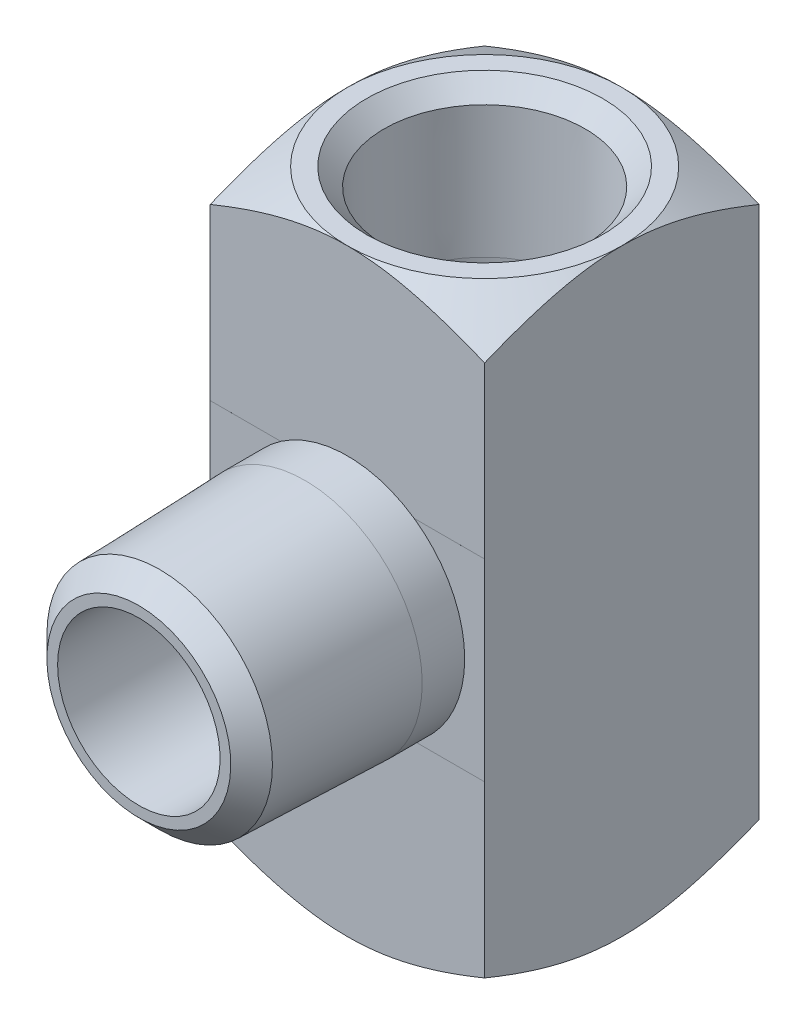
ISO-10303-21;
HEADER;
FILE_DESCRIPTION(('STEP AP214'),'2;1');
FILE_NAME('part.step','',(''),(''),'','','');
FILE_SCHEMA(('AUTOMOTIVE_DESIGN { 1 0 10303 214 1 1 1 1 }'));
ENDSEC;
DATA;
#1=APPLICATION_CONTEXT('core data for automotive mechanical design processes');
#2=APPLICATION_PROTOCOL_DEFINITION('international standard','automotive_design',2000,#1);
#3=PRODUCT_CONTEXT('',#1,'mechanical');
#4=PRODUCT('Part','Part','',(#3));
#5=PRODUCT_RELATED_PRODUCT_CATEGORY('part','',(#4));
#6=PRODUCT_DEFINITION_FORMATION('','',#4);
#7=PRODUCT_DEFINITION_CONTEXT('part definition',#1,'design');
#8=PRODUCT_DEFINITION('design','',#6,#7);
#9=PRODUCT_DEFINITION_SHAPE('','',#8);
#10=(LENGTH_UNIT() NAMED_UNIT(*) SI_UNIT(.MILLI.,.METRE.));
#11=(NAMED_UNIT(*) PLANE_ANGLE_UNIT() SI_UNIT($,.RADIAN.));
#12=(NAMED_UNIT(*) SI_UNIT($,.STERADIAN.) SOLID_ANGLE_UNIT());
#13=UNCERTAINTY_MEASURE_WITH_UNIT(LENGTH_MEASURE(1.E-05),#10,'distance_accuracy_value','');
#14=(GEOMETRIC_REPRESENTATION_CONTEXT(3) GLOBAL_UNCERTAINTY_ASSIGNED_CONTEXT((#13)) GLOBAL_UNIT_ASSIGNED_CONTEXT((#10,
#11,#12)) REPRESENTATION_CONTEXT('',''));
#15=CARTESIAN_POINT('',(0.,0.,0.));
#16=DIRECTION('',(0.,0.,1.));
#17=DIRECTION('',(1.,0.,0.));
#18=AXIS2_PLACEMENT_3D('',#15,#16,#17);
#19=CARTESIAN_POINT('',(0.,0.,-19.304));
#20=DIRECTION('',(0.,0.,1.));
#21=DIRECTION('',(1.,0.,0.));
#22=AXIS2_PLACEMENT_3D('',#19,#20,#21);
#23=PLANE('',#22);
#24=CARTESIAN_POINT('',(0.,0.,-19.304));
#25=DIRECTION('',(0.,0.,-1.));
#26=DIRECTION('',(-1.,0.,0.));
#27=AXIS2_PLACEMENT_3D('',#24,#25,#26);
#28=CIRCLE('',#27,7.5184);
#29=CARTESIAN_POINT('',(-7.5184,0.,-19.304));
#30=VERTEX_POINT('',#29);
#31=EDGE_CURVE('E19',#30,#30,#28,.T.);
#32=ORIENTED_EDGE('',*,*,#31,.T.);
#33=EDGE_LOOP('',(#32));
#34=FACE_BOUND('',#33,.T.);
#35=ADVANCED_FACE('F15',(#34),#23,.F.);
#36=CARTESIAN_POINT('',(0.,0.,-19.304));
#37=DIRECTION('',(0.,0.,-1.));
#38=DIRECTION('',(-1.,0.,0.));
#39=AXIS2_PLACEMENT_3D('',#36,#37,#38);
#40=CYLINDRICAL_SURFACE('',#39,7.5184);
#41=ORIENTED_EDGE('',*,*,#31,.F.);
#42=EDGE_LOOP('',(#41));
#43=FACE_BOUND('',#42,.T.);
#44=CARTESIAN_POINT('',(0.,0.,-32.004));
#45=DIRECTION('',(0.,-0.707106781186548,-0.707106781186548));
#46=DIRECTION('',(0.,0.707106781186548,-0.707106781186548));
#47=AXIS2_PLACEMENT_3D('',#44,#45,#46);
#48=ELLIPSE('',#47,10.6326232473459,7.5184);
#49=CARTESIAN_POINT('',(7.5184,0.,-32.004));
#50=VERTEX_POINT('',#49);
#51=CARTESIAN_POINT('',(-7.5184,0.,-32.004));
#52=VERTEX_POINT('',#51);
#53=EDGE_CURVE('E118',#50,#52,#48,.T.);
#54=ORIENTED_EDGE('',*,*,#53,.T.);
#55=CARTESIAN_POINT('',(0.,0.,-32.004));
#56=DIRECTION('',(0.,0.707106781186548,-0.707106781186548));
#57=DIRECTION('',(0.,-0.707106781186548,-0.707106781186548));
#58=AXIS2_PLACEMENT_3D('',#55,#56,#57);
#59=ELLIPSE('',#58,10.6326232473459,7.5184);
#60=EDGE_CURVE('E115',#52,#50,#59,.T.);
#61=ORIENTED_EDGE('',*,*,#60,.T.);
#62=EDGE_LOOP('',(#54,#61));
#63=FACE_BOUND('',#62,.T.);
#64=ADVANCED_FACE('F119',(#43,#63),#40,.F.);
#65=CARTESIAN_POINT('',(0.,0.,-19.3031999));
#66=DIRECTION('',(0.,0.,1.));
#67=DIRECTION('',(1.,0.,0.));
#68=AXIS2_PLACEMENT_3D('',#65,#66,#67);
#69=PLANE('',#68);
#70=CARTESIAN_POINT('',(0.,0.,-19.3031999));
#71=DIRECTION('',(0.,0.,-1.));
#72=DIRECTION('',(-1.,0.,0.));
#73=AXIS2_PLACEMENT_3D('',#70,#71,#72);
#74=CIRCLE('',#73,7.5184);
#75=CARTESIAN_POINT('',(-7.5184,0.,-19.3031999));
#76=VERTEX_POINT('',#75);
#77=EDGE_CURVE('E123',#76,#76,#74,.F.);
#78=ORIENTED_EDGE('',*,*,#77,.T.);
#79=EDGE_LOOP('',(#78));
#80=FACE_BOUND('',#79,.T.);
#81=ADVANCED_FACE('F777',(#80),#69,.T.);
#82=CARTESIAN_POINT('',(0.,-8.636,-32.004));
#83=DIRECTION('',(0.,1.,0.));
#84=DIRECTION('',(0.,0.,1.));
#85=AXIS2_PLACEMENT_3D('',#82,#83,#84);
#86=CYLINDRICAL_SURFACE('',#85,7.5184);
#87=ORIENTED_EDGE('',*,*,#60,.F.);
#88=ORIENTED_EDGE('',*,*,#53,.F.);
#89=EDGE_LOOP('',(#87,#88));
#90=FACE_BOUND('',#89,.T.);
#91=CARTESIAN_POINT('',(0.,8.636,-32.004));
#92=DIRECTION('',(0.,1.,0.));
#93=DIRECTION('',(0.,0.,1.));
#94=AXIS2_PLACEMENT_3D('',#91,#92,#93);
#95=CIRCLE('',#94,7.5184);
#96=CARTESIAN_POINT('',(0.,8.636,-24.4856));
#97=VERTEX_POINT('',#96);
#98=EDGE_CURVE('E131',#97,#97,#95,.T.);
#99=ORIENTED_EDGE('',*,*,#98,.T.);
#100=EDGE_LOOP('',(#99));
#101=FACE_BOUND('',#100,.T.);
#102=CARTESIAN_POINT('',(0.,-8.636,-32.004));
#103=DIRECTION('',(0.,1.,0.));
#104=DIRECTION('',(0.,0.,1.));
#105=AXIS2_PLACEMENT_3D('',#102,#103,#104);
#106=CIRCLE('',#105,7.5184);
#107=CARTESIAN_POINT('',(0.,-8.636,-24.4856));
#108=VERTEX_POINT('',#107);
#109=EDGE_CURVE('E126',#108,#108,#106,.F.);
#110=ORIENTED_EDGE('',*,*,#109,.T.);
#111=EDGE_LOOP('',(#110));
#112=FACE_BOUND('',#111,.T.);
#113=ADVANCED_FACE('F121',(#90,#101,#112),#86,.F.);
#114=CARTESIAN_POINT('',(0.,0.,0.));
#115=DIRECTION('',(0.,0.,-1.));
#116=DIRECTION('',(-1.,0.,0.));
#117=AXIS2_PLACEMENT_3D('',#114,#115,#116);
#118=CYLINDRICAL_SURFACE('',#117,7.5184);
#119=ORIENTED_EDGE('',*,*,#77,.F.);
#120=EDGE_LOOP('',(#119));
#121=FACE_BOUND('',#120,.T.);
#122=CARTESIAN_POINT('',(0.,0.,0.));
#123=DIRECTION('',(0.,0.,-1.));
#124=DIRECTION('',(-1.,0.,0.));
#125=AXIS2_PLACEMENT_3D('',#122,#123,#124);
#126=CIRCLE('',#125,7.5184);
#127=CARTESIAN_POINT('',(-7.5184,0.,0.));
#128=VERTEX_POINT('',#127);
#129=EDGE_CURVE('E134',#128,#128,#126,.F.);
#130=ORIENTED_EDGE('',*,*,#129,.T.);
#131=EDGE_LOOP('',(#130));
#132=FACE_BOUND('',#131,.T.);
#133=ADVANCED_FACE('F17',(#121,#132),#118,.F.);
#134=CARTESIAN_POINT('',(0.,-8.636,-32.004));
#135=DIRECTION('',(0.,1.,0.));
#136=DIRECTION('',(0.,0.,1.));
#137=AXIS2_PLACEMENT_3D('',#134,#135,#136);
#138=PLANE('',#137);
#139=ORIENTED_EDGE('',*,*,#109,.F.);
#140=EDGE_LOOP('',(#139));
#141=FACE_BOUND('',#140,.T.);
#142=CARTESIAN_POINT('',(0.,-8.636,-32.004));
#143=DIRECTION('',(0.,1.,0.));
#144=DIRECTION('',(0.,0.,1.));
#145=AXIS2_PLACEMENT_3D('',#142,#143,#144);
#146=CIRCLE('',#145,8.92937);
#147=CARTESIAN_POINT('',(0.,-8.636,-23.07463));
#148=VERTEX_POINT('',#147);
#149=EDGE_CURVE('E137',#148,#148,#146,.F.);
#150=ORIENTED_EDGE('',*,*,#149,.T.);
#151=EDGE_LOOP('',(#150));
#152=FACE_BOUND('',#151,.T.);
#153=ADVANCED_FACE('F750',(#141,#152),#138,.F.);
#154=CARTESIAN_POINT('',(0.,8.636,-32.004));
#155=DIRECTION('',(0.,-1.,0.));
#156=DIRECTION('',(0.,0.,-1.));
#157=AXIS2_PLACEMENT_3D('',#154,#155,#156);
#158=PLANE('',#157);
#159=ORIENTED_EDGE('',*,*,#98,.F.);
#160=EDGE_LOOP('',(#159));
#161=FACE_BOUND('',#160,.T.);
#162=CARTESIAN_POINT('',(0.,8.636,-32.004));
#163=DIRECTION('',(0.,-1.,0.));
#164=DIRECTION('',(0.,0.,-1.));
#165=AXIS2_PLACEMENT_3D('',#162,#163,#164);
#166=CIRCLE('',#165,8.92937);
#167=CARTESIAN_POINT('',(0.,8.636,-40.93337));
#168=VERTEX_POINT('',#167);
#169=EDGE_CURVE('E140',#168,#168,#166,.F.);
#170=ORIENTED_EDGE('',*,*,#169,.T.);
#171=EDGE_LOOP('',(#170));
#172=FACE_BOUND('',#171,.T.);
#173=ADVANCED_FACE('F740',(#161,#172),#158,.F.);
#174=CARTESIAN_POINT('',(0.,0.,0.));
#175=DIRECTION('',(0.,0.,-1.));
#176=DIRECTION('',(-1.,0.,0.));
#177=AXIS2_PLACEMENT_3D('',#174,#175,#176);
#178=PLANE('',#177);
#179=ORIENTED_EDGE('',*,*,#129,.F.);
#180=EDGE_LOOP('',(#179));
#181=FACE_BOUND('',#180,.T.);
#182=CARTESIAN_POINT('',(0.,0.,8.64801286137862E-10));
#183=DIRECTION('',(0.,0.,-1.));
#184=DIRECTION('',(0.,1.,0.));
#185=AXIS2_PLACEMENT_3D('',#182,#183,#184);
#186=CIRCLE('',#185,8.50900000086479);
#187=CARTESIAN_POINT('',(0.,8.50900000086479,8.64802700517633E-10));
#188=VERTEX_POINT('',#187);
#189=EDGE_CURVE('E143',#188,#188,#186,.T.);
#190=ORIENTED_EDGE('',*,*,#189,.F.);
#191=EDGE_LOOP('',(#190));
#192=FACE_BOUND('',#191,.T.);
#193=ADVANCED_FACE('F730',(#181,#192),#178,.F.);
#194=CARTESIAN_POINT('',(0.,-27.686,-32.004));
#195=DIRECTION('',(0.,1.,0.));
#196=DIRECTION('',(0.,0.,1.));
#197=AXIS2_PLACEMENT_3D('',#194,#195,#196);
#198=CYLINDRICAL_SURFACE('',#197,8.92937);
#199=ORIENTED_EDGE('',*,*,#149,.F.);
#200=EDGE_LOOP('',(#199));
#201=FACE_BOUND('',#200,.T.);
#202=CARTESIAN_POINT('',(0.,-14.1147799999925,-32.004));
#203=DIRECTION('',(0.,-1.,0.));
#204=DIRECTION('',(0.,0.,1.));
#205=AXIS2_PLACEMENT_3D('',#202,#203,#204);
#206=CIRCLE('',#205,8.9293700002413);
#207=CARTESIAN_POINT('',(0.,-14.1147799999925,-23.0746299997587));
#208=VERTEX_POINT('',#207);
#209=EDGE_CURVE('E146',#208,#208,#206,.T.);
#210=ORIENTED_EDGE('',*,*,#209,.T.);
#211=EDGE_LOOP('',(#210));
#212=FACE_BOUND('',#211,.T.);
#213=ADVANCED_FACE('F419',(#201,#212),#198,.F.);
#214=CARTESIAN_POINT('',(0.,27.686,-32.004));
#215=DIRECTION('',(0.,-1.,0.));
#216=DIRECTION('',(0.,0.,-1.));
#217=AXIS2_PLACEMENT_3D('',#214,#215,#216);
#218=CYLINDRICAL_SURFACE('',#217,8.92937);
#219=ORIENTED_EDGE('',*,*,#169,.F.);
#220=EDGE_LOOP('',(#219));
#221=FACE_BOUND('',#220,.T.);
#222=CARTESIAN_POINT('',(0.,14.1147799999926,-32.004));
#223=DIRECTION('',(0.,1.,0.));
#224=DIRECTION('',(0.,0.,1.));
#225=AXIS2_PLACEMENT_3D('',#222,#223,#224);
#226=CIRCLE('',#225,8.9293700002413);
#227=CARTESIAN_POINT('',(0.,14.1147799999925,-23.0746299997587));
#228=VERTEX_POINT('',#227);
#229=EDGE_CURVE('E414',#228,#228,#226,.T.);
#230=ORIENTED_EDGE('',*,*,#229,.T.);
#231=EDGE_LOOP('',(#230));
#232=FACE_BOUND('',#231,.T.);
#233=ADVANCED_FACE('F711',(#221,#232),#218,.F.);
#234=CARTESIAN_POINT('',(0.,0.,-1.92720840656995));
#235=DIRECTION('',(0.,0.,-1.));
#236=DIRECTION('',(0.,1.,0.));
#237=AXIS2_PLACEMENT_3D('',#234,#235,#236);
#238=CONICAL_SURFACE('',#237,10.4362084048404,0.7853981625);
#239=ORIENTED_EDGE('',*,*,#189,.T.);
#240=EDGE_LOOP('',(#239));
#241=FACE_BOUND('',#240,.T.);
#242=CARTESIAN_POINT('',(0.,0.,-1.9272084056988));
#243=DIRECTION('',(0.,0.,-1.));
#244=DIRECTION('',(1.,0.,0.));
#245=AXIS2_PLACEMENT_3D('',#242,#243,#244);
#246=CIRCLE('',#245,10.4362084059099);
#247=CARTESIAN_POINT('',(10.4362084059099,0.,-1.9272084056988));
#248=VERTEX_POINT('',#247);
#249=EDGE_CURVE('E411',#248,#248,#246,.T.);
#250=ORIENTED_EDGE('',*,*,#249,.F.);
#251=EDGE_LOOP('',(#250));
#252=FACE_BOUND('',#251,.T.);
#253=ADVANCED_FACE('F425',(#241,#252),#238,.T.);
#254=CARTESIAN_POINT('',(0.,-26.0653835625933,-32.004));
#255=DIRECTION('',(0.,-1.,0.));
#256=DIRECTION('',(0.,0.,-1.));
#257=AXIS2_PLACEMENT_3D('',#254,#255,#256);
#258=CONICAL_SURFACE('',#257,9.30138356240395,0.0311192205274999);
#259=ORIENTED_EDGE('',*,*,#209,.F.);
#260=EDGE_LOOP('',(#259));
#261=FACE_BOUND('',#260,.T.);
#262=CARTESIAN_POINT('',(0.,-26.0653835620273,-32.004));
#263=DIRECTION('',(0.,-1.,0.));
#264=DIRECTION('',(0.,0.,1.));
#265=AXIS2_PLACEMENT_3D('',#262,#263,#264);
#266=CIRCLE('',#265,9.30138356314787);
#267=CARTESIAN_POINT('',(0.,-26.0653835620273,-22.7026164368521));
#268=VERTEX_POINT('',#267);
#269=EDGE_CURVE('E408',#268,#268,#266,.T.);
#270=ORIENTED_EDGE('',*,*,#269,.T.);
#271=EDGE_LOOP('',(#270));
#272=FACE_BOUND('',#271,.T.);
#273=ADVANCED_FACE('F421',(#261,#272),#258,.F.);
#274=CARTESIAN_POINT('',(0.,26.0653835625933,-32.004));
#275=DIRECTION('',(0.,1.,0.));
#276=DIRECTION('',(0.,0.,1.));
#277=AXIS2_PLACEMENT_3D('',#274,#275,#276);
#278=CONICAL_SURFACE('',#277,9.30138356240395,0.0311192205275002);
#279=CARTESIAN_POINT('',(0.,26.0653835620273,-32.004));
#280=DIRECTION('',(0.,1.,0.));
#281=DIRECTION('',(0.,0.,1.));
#282=AXIS2_PLACEMENT_3D('',#279,#280,#281);
#283=CIRCLE('',#282,9.30138356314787);
#284=CARTESIAN_POINT('',(0.,26.0653835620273,-22.7026164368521));
#285=VERTEX_POINT('',#284);
#286=EDGE_CURVE('E150',#285,#285,#283,.T.);
#287=ORIENTED_EDGE('',*,*,#286,.T.);
#288=EDGE_LOOP('',(#287));
#289=FACE_BOUND('',#288,.T.);
#290=ORIENTED_EDGE('',*,*,#229,.F.);
#291=EDGE_LOOP('',(#290));
#292=FACE_BOUND('',#291,.T.);
#293=ADVANCED_FACE('F424',(#289,#292),#278,.F.);
#294=CARTESIAN_POINT('',(0.,0.,-15.3705560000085));
#295=DIRECTION('',(0.,0.,-1.));
#296=DIRECTION('',(-1.,0.,0.));
#297=AXIS2_PLACEMENT_3D('',#294,#295,#296);
#298=CONICAL_SURFACE('',#297,10.8546899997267,0.0311192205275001);
#299=ORIENTED_EDGE('',*,*,#249,.T.);
#300=EDGE_LOOP('',(#299));
#301=FACE_BOUND('',#300,.T.);
#302=CARTESIAN_POINT('',(0.,0.,-15.370556));
#303=DIRECTION('',(0.,0.,1.));
#304=DIRECTION('',(1.,0.,0.));
#305=AXIS2_PLACEMENT_3D('',#302,#303,#304);
#306=CIRCLE('',#305,10.85469);
#307=CARTESIAN_POINT('',(10.85469,0.,-15.370556));
#308=VERTEX_POINT('',#307);
#309=EDGE_CURVE('E154',#308,#308,#306,.F.);
#310=ORIENTED_EDGE('',*,*,#309,.F.);
#311=EDGE_LOOP('',(#310));
#312=FACE_BOUND('',#311,.T.);
#313=ADVANCED_FACE('F433',(#301,#312),#298,.T.);
#314=CARTESIAN_POINT('',(0.,-27.6860000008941,-32.004));
#315=DIRECTION('',(0.,-1.,0.));
#316=DIRECTION('',(0.,0.,-1.));
#317=AXIS2_PLACEMENT_3D('',#314,#315,#316);
#318=CONICAL_SURFACE('',#317,10.9219999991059,0.785398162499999);
#319=ORIENTED_EDGE('',*,*,#269,.F.);
#320=EDGE_LOOP('',(#319));
#321=FACE_BOUND('',#320,.T.);
#322=CARTESIAN_POINT('',(0.,-27.6860000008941,-32.004));
#323=DIRECTION('',(0.,-1.,0.));
#324=DIRECTION('',(0.,0.,-1.));
#325=AXIS2_PLACEMENT_3D('',#322,#323,#324);
#326=CIRCLE('',#325,10.9219999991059);
#327=CARTESIAN_POINT('',(0.,-27.6860000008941,-42.9259999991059));
#328=VERTEX_POINT('',#327);
#329=EDGE_CURVE('E157',#328,#328,#326,.T.);
#330=ORIENTED_EDGE('',*,*,#329,.T.);
#331=EDGE_LOOP('',(#330));
#332=FACE_BOUND('',#331,.T.);
#333=ADVANCED_FACE('F429',(#321,#332),#318,.F.);
#334=CARTESIAN_POINT('',(0.,27.6860000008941,-32.004));
#335=DIRECTION('',(0.,1.,0.));
#336=DIRECTION('',(0.,0.,1.));
#337=AXIS2_PLACEMENT_3D('',#334,#335,#336);
#338=CONICAL_SURFACE('',#337,10.9219999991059,0.7853981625);
#339=CARTESIAN_POINT('',(0.,27.6860000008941,-32.004));
#340=DIRECTION('',(0.,1.,0.));
#341=DIRECTION('',(0.,0.,1.));
#342=AXIS2_PLACEMENT_3D('',#339,#340,#341);
#343=CIRCLE('',#342,10.9219999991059);
#344=CARTESIAN_POINT('',(0.,27.6860000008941,-21.0820000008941));
#345=VERTEX_POINT('',#344);
#346=EDGE_CURVE('E171',#345,#345,#343,.F.);
#347=ORIENTED_EDGE('',*,*,#346,.F.);
#348=EDGE_LOOP('',(#347));
#349=FACE_BOUND('',#348,.T.);
#350=ORIENTED_EDGE('',*,*,#286,.F.);
#351=EDGE_LOOP('',(#350));
#352=FACE_BOUND('',#351,.T.);
#353=ADVANCED_FACE('F432',(#349,#352),#338,.F.);
#354=CARTESIAN_POINT('',(-12.7,8.92937,-19.304));
#355=DIRECTION('',(0.,1.,0.));
#356=DIRECTION('',(0.,0.,1.));
#357=AXIS2_PLACEMENT_3D('',#354,#355,#356);
#358=PLANE('',#357);
#359=DIRECTION('',(0.,0.,1.));
#360=VECTOR('',#359,1.);
#361=CARTESIAN_POINT('',(-12.7,8.92937,-19.304));
#362=LINE('',#361,#360);
#363=CARTESIAN_POINT('',(-12.7,8.92937,-19.304));
#364=VERTEX_POINT('',#363);
#365=CARTESIAN_POINT('',(-12.7,8.92937,-19.3031999));
#366=VERTEX_POINT('',#365);
#367=EDGE_CURVE('E147',#364,#366,#362,.T.);
#368=ORIENTED_EDGE('',*,*,#367,.T.);
#369=DIRECTION('',(1.,0.,0.));
#370=VECTOR('',#369,1.);
#371=CARTESIAN_POINT('',(0.,8.92937,-19.3031999));
#372=LINE('',#371,#370);
#373=CARTESIAN_POINT('',(-6.17176201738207,8.92937,-19.30359995));
#374=VERTEX_POINT('',#373);
#375=EDGE_CURVE('E163',#374,#366,#372,.F.);
#376=ORIENTED_EDGE('',*,*,#375,.F.);
#377=DIRECTION('',(1.,0.,0.));
#378=VECTOR('',#377,1.);
#379=CARTESIAN_POINT('',(12.7,8.92937,-19.304));
#380=LINE('',#379,#378);
#381=EDGE_CURVE('E187',#364,#374,#380,.T.);
#382=ORIENTED_EDGE('',*,*,#381,.F.);
#383=EDGE_LOOP('',(#368,#376,#382));
#384=FACE_BOUND('',#383,.T.);
#385=ADVANCED_FACE('F512',(#384),#358,.T.);
#386=CARTESIAN_POINT('',(-12.7,8.92937,-19.304));
#387=DIRECTION('',(0.,1.,0.));
#388=DIRECTION('',(0.,0.,1.));
#389=AXIS2_PLACEMENT_3D('',#386,#387,#388);
#390=PLANE('',#389);
#391=DIRECTION('',(0.,0.,1.));
#392=VECTOR('',#391,1.);
#393=CARTESIAN_POINT('',(12.7,8.92937,-19.304));
#394=LINE('',#393,#392);
#395=CARTESIAN_POINT('',(12.7,8.92937,-19.3031999));
#396=VERTEX_POINT('',#395);
#397=CARTESIAN_POINT('',(12.7,8.92937,-19.304));
#398=VERTEX_POINT('',#397);
#399=EDGE_CURVE('E149',#396,#398,#394,.F.);
#400=ORIENTED_EDGE('',*,*,#399,.T.);
#401=DIRECTION('',(1.,0.,0.));
#402=VECTOR('',#401,1.);
#403=CARTESIAN_POINT('',(12.7,8.92937,-19.304));
#404=LINE('',#403,#402);
#405=CARTESIAN_POINT('',(6.17176201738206,8.92937,-19.30359995));
#406=VERTEX_POINT('',#405);
#407=EDGE_CURVE('E386',#406,#398,#404,.T.);
#408=ORIENTED_EDGE('',*,*,#407,.F.);
#409=DIRECTION('',(1.,0.,0.));
#410=VECTOR('',#409,1.);
#411=CARTESIAN_POINT('',(0.,8.92937,-19.3031999));
#412=LINE('',#411,#410);
#413=EDGE_CURVE('E375',#396,#406,#412,.F.);
#414=ORIENTED_EDGE('',*,*,#413,.F.);
#415=EDGE_LOOP('',(#400,#408,#414));
#416=FACE_BOUND('',#415,.T.);
#417=ADVANCED_FACE('F478',(#416),#390,.T.);
#418=CARTESIAN_POINT('',(12.7,-8.92937,-19.304));
#419=DIRECTION('',(0.,-1.,0.));
#420=DIRECTION('',(0.,0.,-1.));
#421=AXIS2_PLACEMENT_3D('',#418,#419,#420);
#422=PLANE('',#421);
#423=DIRECTION('',(0.,0.,-1.));
#424=VECTOR('',#423,1.);
#425=CARTESIAN_POINT('',(12.7,-8.92937,-19.304));
#426=LINE('',#425,#424);
#427=CARTESIAN_POINT('',(12.7,-8.92937,-19.304));
#428=VERTEX_POINT('',#427);
#429=CARTESIAN_POINT('',(12.7,-8.92937,-19.3031999));
#430=VERTEX_POINT('',#429);
#431=EDGE_CURVE('E152',#428,#430,#426,.F.);
#432=ORIENTED_EDGE('',*,*,#431,.T.);
#433=DIRECTION('',(1.,0.,0.));
#434=VECTOR('',#433,1.);
#435=CARTESIAN_POINT('',(0.,-8.92937,-19.3031999));
#436=LINE('',#435,#434);
#437=CARTESIAN_POINT('',(6.17176201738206,-8.92937,-19.30359995));
#438=VERTEX_POINT('',#437);
#439=EDGE_CURVE('E378',#438,#430,#436,.T.);
#440=ORIENTED_EDGE('',*,*,#439,.F.);
#441=DIRECTION('',(1.,0.,0.));
#442=VECTOR('',#441,1.);
#443=CARTESIAN_POINT('',(12.7,-8.92937,-19.304));
#444=LINE('',#443,#442);
#445=EDGE_CURVE('E282',#428,#438,#444,.F.);
#446=ORIENTED_EDGE('',*,*,#445,.F.);
#447=EDGE_LOOP('',(#432,#440,#446));
#448=FACE_BOUND('',#447,.T.);
#449=ADVANCED_FACE('F658',(#448),#422,.T.);
#450=CARTESIAN_POINT('',(0.,0.,-32.004));
#451=DIRECTION('',(0.,0.,1.));
#452=DIRECTION('',(1.,0.,0.));
#453=AXIS2_PLACEMENT_3D('',#450,#451,#452);
#454=CYLINDRICAL_SURFACE('',#453,10.85469);
#455=CARTESIAN_POINT('',(0.,0.,-19.304));
#456=DIRECTION('',(0.,0.,1.));
#457=DIRECTION('',(1.,0.,0.));
#458=AXIS2_PLACEMENT_3D('',#455,#456,#457);
#459=CIRCLE('',#458,10.85469);
#460=EDGE_CURVE('E389',#374,#406,#459,.F.);
#461=ORIENTED_EDGE('',*,*,#460,.F.);
#462=CARTESIAN_POINT('',(0.,0.,-19.3031999));
#463=DIRECTION('',(0.,0.,1.));
#464=DIRECTION('',(1.,0.,0.));
#465=AXIS2_PLACEMENT_3D('',#462,#463,#464);
#466=CIRCLE('',#465,10.85469);
#467=CARTESIAN_POINT('',(-6.17176201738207,-8.92937,-19.30359995));
#468=VERTEX_POINT('',#467);
#469=EDGE_CURVE('E166',#468,#374,#466,.F.);
#470=ORIENTED_EDGE('',*,*,#469,.F.);
#471=CARTESIAN_POINT('',(0.,0.,-19.304));
#472=DIRECTION('',(0.,0.,1.));
#473=DIRECTION('',(1.,0.,0.));
#474=AXIS2_PLACEMENT_3D('',#471,#472,#473);
#475=CIRCLE('',#474,10.85469);
#476=EDGE_CURVE('E368',#438,#468,#475,.F.);
#477=ORIENTED_EDGE('',*,*,#476,.F.);
#478=CARTESIAN_POINT('',(0.,0.,-19.3031999));
#479=DIRECTION('',(0.,0.,1.));
#480=DIRECTION('',(1.,0.,0.));
#481=AXIS2_PLACEMENT_3D('',#478,#479,#480);
#482=CIRCLE('',#481,10.85469);
#483=EDGE_CURVE('E377',#406,#438,#482,.F.);
#484=ORIENTED_EDGE('',*,*,#483,.F.);
#485=EDGE_LOOP('',(#461,#470,#477,#484));
#486=FACE_BOUND('',#485,.T.);
#487=ORIENTED_EDGE('',*,*,#309,.T.);
#488=EDGE_LOOP('',(#487));
#489=FACE_BOUND('',#488,.T.);
#490=ADVANCED_FACE('F472',(#486,#489),#454,.T.);
#491=CARTESIAN_POINT('',(12.7,-8.92937,-19.304));
#492=DIRECTION('',(0.,-1.,0.));
#493=DIRECTION('',(0.,0.,-1.));
#494=AXIS2_PLACEMENT_3D('',#491,#492,#493);
#495=PLANE('',#494);
#496=DIRECTION('',(0.,0.,-1.));
#497=VECTOR('',#496,1.);
#498=CARTESIAN_POINT('',(-12.7,-8.92937,-19.304));
#499=LINE('',#498,#497);
#500=CARTESIAN_POINT('',(-12.7,-8.92937,-19.3031999));
#501=VERTEX_POINT('',#500);
#502=CARTESIAN_POINT('',(-12.7,-8.92937,-19.304));
#503=VERTEX_POINT('',#502);
#504=EDGE_CURVE('E155',#501,#503,#499,.T.);
#505=ORIENTED_EDGE('',*,*,#504,.T.);
#506=DIRECTION('',(1.,0.,0.));
#507=VECTOR('',#506,1.);
#508=CARTESIAN_POINT('',(12.7,-8.92937,-19.304));
#509=LINE('',#508,#507);
#510=EDGE_CURVE('E364',#468,#503,#509,.F.);
#511=ORIENTED_EDGE('',*,*,#510,.F.);
#512=DIRECTION('',(1.,0.,0.));
#513=VECTOR('',#512,1.);
#514=CARTESIAN_POINT('',(0.,-8.92937,-19.3031999));
#515=LINE('',#514,#513);
#516=EDGE_CURVE('E169',#501,#468,#515,.T.);
#517=ORIENTED_EDGE('',*,*,#516,.F.);
#518=EDGE_LOOP('',(#505,#511,#517));
#519=FACE_BOUND('',#518,.T.);
#520=ADVANCED_FACE('F441',(#519),#495,.T.);
#521=CARTESIAN_POINT('',(0.,-27.686,-32.004));
#522=DIRECTION('',(0.,1.,0.));
#523=DIRECTION('',(0.,0.,1.));
#524=AXIS2_PLACEMENT_3D('',#521,#522,#523);
#525=PLANE('',#524);
#526=ORIENTED_EDGE('',*,*,#329,.F.);
#527=EDGE_LOOP('',(#526));
#528=FACE_BOUND('',#527,.T.);
#529=CARTESIAN_POINT('',(0.,-27.6860000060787,-32.004));
#530=DIRECTION('',(0.,1.,0.));
#531=DIRECTION('',(-1.,0.,0.));
#532=AXIS2_PLACEMENT_3D('',#529,#530,#531);
#533=CIRCLE('',#532,12.7000000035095);
#534=CARTESIAN_POINT('',(0.,-27.6860000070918,-19.3039999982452));
#535=VERTEX_POINT('',#534);
#536=CARTESIAN_POINT('',(12.7000000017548,-27.6860000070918,-32.004));
#537=VERTEX_POINT('',#536);
#538=EDGE_CURVE('E174',#535,#537,#533,.T.);
#539=ORIENTED_EDGE('',*,*,#538,.F.);
#540=CARTESIAN_POINT('',(0.,-27.6860000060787,-32.004));
#541=DIRECTION('',(0.,1.,0.));
#542=DIRECTION('',(0.,0.,1.));
#543=AXIS2_PLACEMENT_3D('',#540,#541,#542);
#544=CIRCLE('',#543,12.7000000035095);
#545=CARTESIAN_POINT('',(-12.7000000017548,-27.6860000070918,-32.004));
#546=VERTEX_POINT('',#545);
#547=EDGE_CURVE('E160',#546,#535,#544,.T.);
#548=ORIENTED_EDGE('',*,*,#547,.F.);
#549=CARTESIAN_POINT('',(0.,-27.6860000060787,-32.004));
#550=DIRECTION('',(0.,1.,0.));
#551=DIRECTION('',(0.,0.,1.));
#552=AXIS2_PLACEMENT_3D('',#549,#550,#551);
#553=CIRCLE('',#552,12.7000000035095);
#554=CARTESIAN_POINT('',(0.,-27.6860000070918,-44.7040000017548));
#555=VERTEX_POINT('',#554);
#556=EDGE_CURVE('E517',#555,#546,#553,.T.);
#557=ORIENTED_EDGE('',*,*,#556,.F.);
#558=CARTESIAN_POINT('',(0.,-27.6860000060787,-32.004));
#559=DIRECTION('',(0.,1.,0.));
#560=DIRECTION('',(0.,0.,1.));
#561=AXIS2_PLACEMENT_3D('',#558,#559,#560);
#562=CIRCLE('',#561,12.7000000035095);
#563=EDGE_CURVE('E367',#537,#555,#562,.T.);
#564=ORIENTED_EDGE('',*,*,#563,.F.);
#565=EDGE_LOOP('',(#539,#548,#557,#564));
#566=FACE_BOUND('',#565,.T.);
#567=ADVANCED_FACE('F437',(#528,#566),#525,.F.);
#568=CARTESIAN_POINT('',(0.,-24.6306189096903,-32.004));
#569=DIRECTION('',(0.,1.,0.));
#570=DIRECTION('',(0.,0.,1.));
#571=AXIS2_PLACEMENT_3D('',#568,#569,#570);
#572=CONICAL_SURFACE('',#571,17.9920752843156,1.04719755);
#573=CARTESIAN_POINT('',(-12.6999999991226,-27.6860000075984,-32.004));
#574=CARTESIAN_POINT('',(-12.6999999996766,-27.6860046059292,-31.8206899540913));
#575=CARTESIAN_POINT('',(-12.6999999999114,-27.6837079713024,-31.6373878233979));
#576=CARTESIAN_POINT('',(-12.7000000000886,-27.6745538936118,-31.2709026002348));
#577=CARTESIAN_POINT('',(-12.7000000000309,-27.6676965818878,-31.0877195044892));
#578=CARTESIAN_POINT('',(-12.6999999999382,-27.6403542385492,-30.5386549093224));
#579=CARTESIAN_POINT('',(-12.6999999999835,-27.6130987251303,-30.1730905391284));
#580=CARTESIAN_POINT('',(-12.7000000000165,-27.5414746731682,-29.4448301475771));
#581=CARTESIAN_POINT('',(-12.7000000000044,-27.4971599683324,-29.0821287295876));
#582=CARTESIAN_POINT('',(-12.6999999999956,-27.3926585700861,-28.3590023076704));
#583=CARTESIAN_POINT('',(-12.6999999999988,-27.3324704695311,-27.9985775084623));
#584=CARTESIAN_POINT('',(-12.7000000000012,-27.198417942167,-27.2841547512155));
#585=CARTESIAN_POINT('',(-12.7000000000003,-27.1247012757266,-26.930128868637));
#586=CARTESIAN_POINT('',(-12.6999999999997,-26.9647296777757,-26.2249513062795));
#587=CARTESIAN_POINT('',(-12.6999999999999,-26.8784748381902,-25.8737996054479));
#588=CARTESIAN_POINT('',(-12.7000000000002,-26.6030888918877,-24.8242343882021));
#589=CARTESIAN_POINT('',(-12.7,-26.3974185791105,-24.1301298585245));
#590=CARTESIAN_POINT('',(-12.7,-26.0625327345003,-23.0925844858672));
#591=CARTESIAN_POINT('',(-12.7,-25.945636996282,-22.7450313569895));
#592=CARTESIAN_POINT('',(-12.7,-25.7044915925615,-22.0526152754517));
#593=CARTESIAN_POINT('',(-12.7,-25.5802446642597,-21.7077513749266));
#594=CARTESIAN_POINT('',(-12.7,-25.3246998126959,-21.0185229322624));
#595=CARTESIAN_POINT('',(-12.7,-25.1933671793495,-20.6741713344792));
#596=CARTESIAN_POINT('',(-12.7,-24.9250920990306,-19.9875535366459));
#597=CARTESIAN_POINT('',(-12.7,-24.7881481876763,-19.6452879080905));
#598=CARTESIAN_POINT('',(-12.7,-24.6488418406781,-19.304000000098));
#599=B_SPLINE_CURVE_WITH_KNOTS('',3,(#573,#574,#575,#576,#577,#578,#579,#580,#581,#582,#583,
#584,#585,#586,#587,#588,#589,#590,#591,#592,#593,#594,#595,#596,#597,#598),.UNSPECIFIED.,.F.,
.F.,(4,2,2,2,2,2,2,2,2,2,2,2,4),(0.,0.549900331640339,1.09978482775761,2.19905169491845,
3.29487767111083,4.39080082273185,5.47539858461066,6.55998839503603,8.73044680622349,
9.83045639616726,10.9300589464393,12.0356490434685,13.1415295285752),.UNSPECIFIED.);
#600=CARTESIAN_POINT('',(-12.6999999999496,-24.6488418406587,-19.304));
#601=VERTEX_POINT('',#600);
#602=EDGE_CURVE('E221',#546,#601,#599,.T.);
#603=ORIENTED_EDGE('',*,*,#602,.F.);
#604=ORIENTED_EDGE('',*,*,#547,.T.);
#605=CARTESIAN_POINT('',(-12.6999999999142,-24.6488418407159,-19.3039999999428));
#606=CARTESIAN_POINT('',(-12.4461196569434,-24.752482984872,-19.3039999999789));
#607=CARTESIAN_POINT('',(-12.191699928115,-24.8548012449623,-19.3039999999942));
#608=CARTESIAN_POINT('',(-11.6816738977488,-25.0564723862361,-19.3040000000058));
#609=CARTESIAN_POINT('',(-11.4260675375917,-25.1558251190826,-19.304000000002));
#610=CARTESIAN_POINT('',(-10.6571003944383,-25.4490334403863,-19.303999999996));
#611=CARTESIAN_POINT('',(-10.1418336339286,-25.6379396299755,-19.3039999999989));
#612=CARTESIAN_POINT('',(-9.11044459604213,-25.9975778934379,-19.3040000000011));
#613=CARTESIAN_POINT('',(-8.59437683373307,-26.1684654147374,-19.3040000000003));
#614=CARTESIAN_POINT('',(-7.55596942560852,-26.4901448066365,-19.3039999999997));
#615=CARTESIAN_POINT('',(-7.03362995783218,-26.6409372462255,-19.3039999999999));
#616=CARTESIAN_POINT('',(-5.979493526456,-26.9184886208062,-19.3040000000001));
#617=CARTESIAN_POINT('',(-5.44766053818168,-27.0451121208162,-19.304));
#618=CARTESIAN_POINT('',(-4.37771854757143,-27.2679499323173,-19.304));
#619=CARTESIAN_POINT('',(-3.83961195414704,-27.3641755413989,-19.304));
#620=CARTESIAN_POINT('',(-3.02614035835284,-27.4822651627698,-19.304));
#621=CARTESIAN_POINT('',(-2.7526601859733,-27.5173533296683,-19.304));
#622=CARTESIAN_POINT('',(-2.20463642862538,-27.5779603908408,-19.304));
#623=CARTESIAN_POINT('',(-1.93009287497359,-27.6034795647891,-19.304));
#624=CARTESIAN_POINT('',(-1.37983879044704,-27.6445318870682,-19.304));
#625=CARTESIAN_POINT('',(-1.10412712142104,-27.6600498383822,-19.304));
#626=CARTESIAN_POINT('',(-0.552280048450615,-27.6808008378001,-19.304));
#627=CARTESIAN_POINT('',(-0.276144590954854,-27.6860324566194,-19.304));
#628=CARTESIAN_POINT('',(-2.06806368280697E-10,-27.6860000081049,-19.304));
#629=B_SPLINE_CURVE_WITH_KNOTS('',3,(#605,#606,#607,#608,#609,#610,#611,#612,#613,#614,#615,
#616,#617,#618,#619,#620,#621,#622,#623,#624,#625,#626,#627,#628),.UNSPECIFIED.,.F.,.F.,(4,2,2,
2,2,2,2,2,2,2,2,4),(0.,0.822653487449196,1.64534805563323,3.29152221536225,4.92207553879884,
6.55258268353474,8.19197440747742,9.83075612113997,10.6577807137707,11.4847811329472,
12.3130352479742,13.1414044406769),.UNSPECIFIED.);
#630=EDGE_CURVE('E283',#601,#535,#629,.T.);
#631=ORIENTED_EDGE('',*,*,#630,.F.);
#632=EDGE_LOOP('',(#603,#604,#631));
#633=FACE_BOUND('',#632,.T.);
#634=ADVANCED_FACE('F440',(#633),#572,.T.);
#635=CARTESIAN_POINT('',(0.,0.,-19.3031999));
#636=DIRECTION('',(0.,0.,1.));
#637=DIRECTION('',(1.,0.,0.));
#638=AXIS2_PLACEMENT_3D('',#635,#636,#637);
#639=PLANE('',#638);
#640=ORIENTED_EDGE('',*,*,#516,.T.);
#641=ORIENTED_EDGE('',*,*,#469,.T.);
#642=ORIENTED_EDGE('',*,*,#375,.T.);
#643=DIRECTION('',(0.,1.,0.));
#644=VECTOR('',#643,1.);
#645=CARTESIAN_POINT('',(-12.7,0.,-19.3031999));
#646=LINE('',#645,#644);
#647=EDGE_CURVE('E358',#501,#366,#646,.T.);
#648=ORIENTED_EDGE('',*,*,#647,.F.);
#649=EDGE_LOOP('',(#640,#641,#642,#648));
#650=FACE_BOUND('',#649,.T.);
#651=ADVANCED_FACE('F200',(#650),#639,.T.);
#652=CARTESIAN_POINT('',(0.,24.6306189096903,-32.004));
#653=DIRECTION('',(0.,-1.,0.));
#654=DIRECTION('',(0.,0.,-1.));
#655=AXIS2_PLACEMENT_3D('',#652,#653,#654);
#656=CONICAL_SURFACE('',#655,17.9920752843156,1.04719755);
#657=CARTESIAN_POINT('',(0.,27.6860000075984,-19.3040000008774));
#658=CARTESIAN_POINT('',(-0.183310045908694,27.6860046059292,-19.3040000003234));
#659=CARTESIAN_POINT('',(-0.366612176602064,27.6837079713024,-19.3040000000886));
#660=CARTESIAN_POINT('',(-0.733097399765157,27.6745538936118,-19.3039999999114));
#661=CARTESIAN_POINT('',(-0.916280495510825,27.6676965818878,-19.3039999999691));
#662=CARTESIAN_POINT('',(-1.46534509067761,27.6403542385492,-19.3040000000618));
#663=CARTESIAN_POINT('',(-1.83090946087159,27.6130987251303,-19.3040000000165));
#664=CARTESIAN_POINT('',(-2.55916985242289,27.5414746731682,-19.3039999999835));
#665=CARTESIAN_POINT('',(-2.92187127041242,27.4971599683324,-19.3039999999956));
#666=CARTESIAN_POINT('',(-3.64499769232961,27.3926585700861,-19.3040000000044));
#667=CARTESIAN_POINT('',(-4.00542249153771,27.3324704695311,-19.3040000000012));
#668=CARTESIAN_POINT('',(-4.71984524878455,27.198417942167,-19.3039999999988));
#669=CARTESIAN_POINT('',(-5.07387113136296,27.1247012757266,-19.3039999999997));
#670=CARTESIAN_POINT('',(-5.7790486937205,26.9647296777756,-19.3040000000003));
#671=CARTESIAN_POINT('',(-6.13020039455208,26.8784748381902,-19.3040000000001));
#672=CARTESIAN_POINT('',(-7.1797656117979,26.6030888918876,-19.3039999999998));
#673=CARTESIAN_POINT('',(-7.87387014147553,26.3974185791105,-19.304));
#674=CARTESIAN_POINT('',(-8.91141551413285,26.0625327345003,-19.304));
#675=CARTESIAN_POINT('',(-9.25896864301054,25.945636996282,-19.304));
#676=CARTESIAN_POINT('',(-9.95138472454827,25.7044915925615,-19.304));
#677=CARTESIAN_POINT('',(-10.2962486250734,25.5802446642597,-19.304));
#678=CARTESIAN_POINT('',(-10.9854770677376,25.3246998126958,-19.304));
#679=CARTESIAN_POINT('',(-11.3298286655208,25.1933671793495,-19.304));
#680=CARTESIAN_POINT('',(-12.0164464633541,24.9250920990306,-19.304));
#681=CARTESIAN_POINT('',(-12.3587120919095,24.7881481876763,-19.304));
#682=CARTESIAN_POINT('',(-12.699999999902,24.6488418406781,-19.304));
#683=B_SPLINE_CURVE_WITH_KNOTS('',3,(#657,#658,#659,#660,#661,#662,#663,#664,#665,#666,#667,
#668,#669,#670,#671,#672,#673,#674,#675,#676,#677,#678,#679,#680,#681,#682),.UNSPECIFIED.,.F.,
.F.,(4,2,2,2,2,2,2,2,2,2,2,2,4),(0.,0.549900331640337,1.09978482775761,2.19905169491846,
3.29487767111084,4.39080082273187,5.47539858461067,6.55998839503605,8.7304468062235,
9.83045639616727,10.9300589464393,12.0356490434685,13.1415295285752),.UNSPECIFIED.);
#684=CARTESIAN_POINT('',(0.,27.6860000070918,-19.3039999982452));
#685=VERTEX_POINT('',#684);
#686=CARTESIAN_POINT('',(-12.6999999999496,24.6488418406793,-19.3040000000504));
#687=VERTEX_POINT('',#686);
#688=EDGE_CURVE('E180',#685,#687,#683,.T.);
#689=ORIENTED_EDGE('',*,*,#688,.F.);
#690=CARTESIAN_POINT('',(0.,27.6860000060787,-32.004));
#691=DIRECTION('',(0.,-1.,0.));
#692=DIRECTION('',(0.,0.,-1.));
#693=AXIS2_PLACEMENT_3D('',#690,#691,#692);
#694=CIRCLE('',#693,12.7000000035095);
#695=CARTESIAN_POINT('',(-12.7000000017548,27.6860000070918,-32.004));
#696=VERTEX_POINT('',#695);
#697=EDGE_CURVE('E168',#696,#685,#694,.F.);
#698=ORIENTED_EDGE('',*,*,#697,.F.);
#699=CARTESIAN_POINT('',(-12.7000000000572,24.6488418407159,-19.3040000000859));
#700=CARTESIAN_POINT('',(-12.7000000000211,24.752482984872,-19.5578803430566));
#701=CARTESIAN_POINT('',(-12.7000000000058,24.8548012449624,-19.812300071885));
#702=CARTESIAN_POINT('',(-12.6999999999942,25.0564723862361,-20.3223261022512));
#703=CARTESIAN_POINT('',(-12.699999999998,25.1558251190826,-20.5779324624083));
#704=CARTESIAN_POINT('',(-12.700000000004,25.4490334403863,-21.3468996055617));
#705=CARTESIAN_POINT('',(-12.7000000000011,25.6379396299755,-21.8621663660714));
#706=CARTESIAN_POINT('',(-12.6999999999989,25.9975778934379,-22.8935554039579));
#707=CARTESIAN_POINT('',(-12.6999999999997,26.1684654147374,-23.4096231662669));
#708=CARTESIAN_POINT('',(-12.7000000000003,26.4901448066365,-24.4480305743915));
#709=CARTESIAN_POINT('',(-12.7000000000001,26.6409372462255,-24.9703700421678));
#710=CARTESIAN_POINT('',(-12.6999999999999,26.9184886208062,-26.024506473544));
#711=CARTESIAN_POINT('',(-12.7,27.0451121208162,-26.5563394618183));
#712=CARTESIAN_POINT('',(-12.7,27.2679499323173,-27.6262814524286));
#713=CARTESIAN_POINT('',(-12.7,27.3641755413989,-28.164388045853));
#714=CARTESIAN_POINT('',(-12.7,27.4822651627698,-28.9778596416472));
#715=CARTESIAN_POINT('',(-12.7,27.5173533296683,-29.2513398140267));
#716=CARTESIAN_POINT('',(-12.7,27.5779603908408,-29.7993635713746));
#717=CARTESIAN_POINT('',(-12.7,27.6034795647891,-30.0739071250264));
#718=CARTESIAN_POINT('',(-12.7,27.6445318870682,-30.624161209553));
#719=CARTESIAN_POINT('',(-12.7,27.6600498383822,-30.899872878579));
#720=CARTESIAN_POINT('',(-12.7,27.6808008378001,-31.4517199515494));
#721=CARTESIAN_POINT('',(-12.7,27.6860324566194,-31.7278554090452));
#722=CARTESIAN_POINT('',(-12.7,27.6860000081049,-32.0039999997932));
#723=B_SPLINE_CURVE_WITH_KNOTS('',3,(#699,#700,#701,#702,#703,#704,#705,#706,#707,#708,#709,
#710,#711,#712,#713,#714,#715,#716,#717,#718,#719,#720,#721,#722),.UNSPECIFIED.,.F.,.F.,(4,2,2,
2,2,2,2,2,2,2,2,4),(0.,0.822653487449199,1.64534805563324,3.29152221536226,4.92207553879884,
6.55258268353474,8.19197440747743,9.83075612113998,10.6577807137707,11.4847811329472,
12.3130352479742,13.1414044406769),.UNSPECIFIED.);
#724=EDGE_CURVE('E206',#687,#696,#723,.T.);
#725=ORIENTED_EDGE('',*,*,#724,.F.);
#726=EDGE_LOOP('',(#689,#698,#725));
#727=FACE_BOUND('',#726,.T.);
#728=ADVANCED_FACE('F194',(#727),#656,.T.);
#729=CARTESIAN_POINT('',(0.,27.686,-32.004));
#730=DIRECTION('',(0.,1.,0.));
#731=DIRECTION('',(0.,0.,1.));
#732=AXIS2_PLACEMENT_3D('',#729,#730,#731);
#733=PLANE('',#732);
#734=ORIENTED_EDGE('',*,*,#346,.T.);
#735=EDGE_LOOP('',(#734));
#736=FACE_BOUND('',#735,.T.);
#737=CARTESIAN_POINT('',(0.,27.6860000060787,-32.004));
#738=DIRECTION('',(0.,-1.,0.));
#739=DIRECTION('',(0.,0.,-1.));
#740=AXIS2_PLACEMENT_3D('',#737,#738,#739);
#741=CIRCLE('',#740,12.7000000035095);
#742=CARTESIAN_POINT('',(0.,27.6860000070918,-44.7040000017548));
#743=VERTEX_POINT('',#742);
#744=EDGE_CURVE('E246',#696,#743,#741,.T.);
#745=ORIENTED_EDGE('',*,*,#744,.F.);
#746=ORIENTED_EDGE('',*,*,#697,.T.);
#747=CARTESIAN_POINT('',(0.,27.6860000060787,-32.004));
#748=DIRECTION('',(0.,-1.,0.));
#749=DIRECTION('',(0.,0.,-1.));
#750=AXIS2_PLACEMENT_3D('',#747,#748,#749);
#751=CIRCLE('',#750,12.7000000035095);
#752=CARTESIAN_POINT('',(12.7000000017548,27.6860000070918,-32.004));
#753=VERTEX_POINT('',#752);
#754=EDGE_CURVE('E177',#753,#685,#751,.T.);
#755=ORIENTED_EDGE('',*,*,#754,.F.);
#756=CARTESIAN_POINT('',(0.,27.6860000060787,-32.004));
#757=DIRECTION('',(0.,-1.,0.));
#758=DIRECTION('',(0.,0.,-1.));
#759=AXIS2_PLACEMENT_3D('',#756,#757,#758);
#760=CIRCLE('',#759,12.7000000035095);
#761=EDGE_CURVE('E249',#743,#753,#760,.T.);
#762=ORIENTED_EDGE('',*,*,#761,.F.);
#763=EDGE_LOOP('',(#745,#746,#755,#762));
#764=FACE_BOUND('',#763,.T.);
#765=ADVANCED_FACE('F199',(#736,#764),#733,.T.);
#766=CARTESIAN_POINT('',(0.,-24.6306189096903,-32.004));
#767=DIRECTION('',(0.,1.,0.));
#768=DIRECTION('',(-1.,0.,0.));
#769=AXIS2_PLACEMENT_3D('',#766,#767,#768);
#770=CONICAL_SURFACE('',#769,17.9920752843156,1.04719755);
#771=ORIENTED_EDGE('',*,*,#538,.T.);
#772=CARTESIAN_POINT('',(12.7000000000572,-24.6488418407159,-19.3040000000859));
#773=CARTESIAN_POINT('',(12.7000000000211,-24.752482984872,-19.5578803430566));
#774=CARTESIAN_POINT('',(12.7000000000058,-24.8548012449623,-19.812300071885));
#775=CARTESIAN_POINT('',(12.6999999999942,-25.0564723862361,-20.3223261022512));
#776=CARTESIAN_POINT('',(12.699999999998,-25.1558251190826,-20.5779324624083));
#777=CARTESIAN_POINT('',(12.700000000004,-25.4490334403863,-21.3468996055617));
#778=CARTESIAN_POINT('',(12.7000000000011,-25.6379396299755,-21.8621663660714));
#779=CARTESIAN_POINT('',(12.6999999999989,-25.9975778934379,-22.8935554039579));
#780=CARTESIAN_POINT('',(12.6999999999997,-26.1684654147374,-23.4096231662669));
#781=CARTESIAN_POINT('',(12.7000000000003,-26.4901448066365,-24.4480305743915));
#782=CARTESIAN_POINT('',(12.7000000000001,-26.6409372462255,-24.9703700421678));
#783=CARTESIAN_POINT('',(12.6999999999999,-26.9184886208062,-26.024506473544));
#784=CARTESIAN_POINT('',(12.7,-27.0451121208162,-26.5563394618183));
#785=CARTESIAN_POINT('',(12.7,-27.2679499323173,-27.6262814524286));
#786=CARTESIAN_POINT('',(12.7,-27.3641755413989,-28.164388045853));
#787=CARTESIAN_POINT('',(12.7,-27.4822651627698,-28.9778596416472));
#788=CARTESIAN_POINT('',(12.7,-27.5173533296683,-29.2513398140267));
#789=CARTESIAN_POINT('',(12.7,-27.5779603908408,-29.7993635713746));
#790=CARTESIAN_POINT('',(12.7,-27.6034795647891,-30.0739071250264));
#791=CARTESIAN_POINT('',(12.7,-27.6445318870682,-30.624161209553));
#792=CARTESIAN_POINT('',(12.7,-27.6600498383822,-30.899872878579));
#793=CARTESIAN_POINT('',(12.7,-27.6808008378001,-31.4517199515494));
#794=CARTESIAN_POINT('',(12.7,-27.6860324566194,-31.7278554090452));
#795=CARTESIAN_POINT('',(12.7,-27.6860000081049,-32.0039999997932));
#796=B_SPLINE_CURVE_WITH_KNOTS('',3,(#772,#773,#774,#775,#776,#777,#778,#779,#780,#781,#782,
#783,#784,#785,#786,#787,#788,#789,#790,#791,#792,#793,#794,#795),.UNSPECIFIED.,.F.,.F.,(4,2,2,
2,2,2,2,2,2,2,2,4),(0.,0.822653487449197,1.64534805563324,3.29152221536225,4.92207553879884,
6.55258268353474,8.19197440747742,9.83075612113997,10.6577807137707,11.4847811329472,
12.3130352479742,13.1414044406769),.UNSPECIFIED.);
#797=CARTESIAN_POINT('',(12.6999999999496,-24.6488418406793,-19.3040000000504));
#798=VERTEX_POINT('',#797);
#799=EDGE_CURVE('E251',#798,#537,#796,.T.);
#800=ORIENTED_EDGE('',*,*,#799,.F.);
#801=CARTESIAN_POINT('',(0.,-27.6860000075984,-19.3040000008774));
#802=CARTESIAN_POINT('',(0.183310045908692,-27.6860046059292,-19.3040000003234));
#803=CARTESIAN_POINT('',(0.366612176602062,-27.6837079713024,-19.3040000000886));
#804=CARTESIAN_POINT('',(0.733097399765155,-27.6745538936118,-19.3039999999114));
#805=CARTESIAN_POINT('',(0.916280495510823,-27.6676965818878,-19.3039999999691));
#806=CARTESIAN_POINT('',(1.46534509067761,-27.6403542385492,-19.3040000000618));
#807=CARTESIAN_POINT('',(1.83090946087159,-27.6130987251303,-19.3040000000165));
#808=CARTESIAN_POINT('',(2.55916985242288,-27.5414746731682,-19.3039999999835));
#809=CARTESIAN_POINT('',(2.92187127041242,-27.4971599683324,-19.3039999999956));
#810=CARTESIAN_POINT('',(3.64499769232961,-27.3926585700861,-19.3040000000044));
#811=CARTESIAN_POINT('',(4.0054224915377,-27.3324704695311,-19.3040000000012));
#812=CARTESIAN_POINT('',(4.71984524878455,-27.198417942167,-19.3039999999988));
#813=CARTESIAN_POINT('',(5.07387113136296,-27.1247012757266,-19.3039999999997));
#814=CARTESIAN_POINT('',(5.7790486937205,-26.9647296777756,-19.3040000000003));
#815=CARTESIAN_POINT('',(6.13020039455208,-26.8784748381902,-19.3040000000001));
#816=CARTESIAN_POINT('',(7.1797656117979,-26.6030888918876,-19.3039999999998));
#817=CARTESIAN_POINT('',(7.87387014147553,-26.3974185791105,-19.304));
#818=CARTESIAN_POINT('',(8.91141551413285,-26.0625327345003,-19.304));
#819=CARTESIAN_POINT('',(9.25896864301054,-25.945636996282,-19.304));
#820=CARTESIAN_POINT('',(9.95138472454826,-25.7044915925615,-19.304));
#821=CARTESIAN_POINT('',(10.2962486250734,-25.5802446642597,-19.304));
#822=CARTESIAN_POINT('',(10.9854770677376,-25.3246998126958,-19.304));
#823=CARTESIAN_POINT('',(11.3298286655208,-25.1933671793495,-19.304));
#824=CARTESIAN_POINT('',(12.0164464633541,-24.9250920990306,-19.304));
#825=CARTESIAN_POINT('',(12.3587120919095,-24.7881481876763,-19.304));
#826=CARTESIAN_POINT('',(12.699999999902,-24.6488418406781,-19.304));
#827=B_SPLINE_CURVE_WITH_KNOTS('',3,(#801,#802,#803,#804,#805,#806,#807,#808,#809,#810,#811,
#812,#813,#814,#815,#816,#817,#818,#819,#820,#821,#822,#823,#824,#825,#826),.UNSPECIFIED.,.F.,
.F.,(4,2,2,2,2,2,2,2,2,2,2,2,4),(0.,0.549900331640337,1.09978482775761,2.19905169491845,
3.29487767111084,4.39080082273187,5.47539858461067,6.55998839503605,8.73044680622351,
9.83045639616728,10.9300589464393,12.0356490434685,13.1415295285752),.UNSPECIFIED.);
#828=EDGE_CURVE('E274',#535,#798,#827,.T.);
#829=ORIENTED_EDGE('',*,*,#828,.F.);
#830=EDGE_LOOP('',(#771,#800,#829));
#831=FACE_BOUND('',#830,.T.);
#832=ADVANCED_FACE('F266',(#831),#770,.T.);
#833=CARTESIAN_POINT('',(0.,24.6306189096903,-32.004));
#834=DIRECTION('',(0.,-1.,0.));
#835=DIRECTION('',(0.,0.,-1.));
#836=AXIS2_PLACEMENT_3D('',#833,#834,#835);
#837=CONICAL_SURFACE('',#836,17.9920752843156,1.04719755);
#838=ORIENTED_EDGE('',*,*,#754,.T.);
#839=CARTESIAN_POINT('',(12.6999999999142,24.6488418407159,-19.3039999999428));
#840=CARTESIAN_POINT('',(12.4461196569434,24.752482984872,-19.3039999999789));
#841=CARTESIAN_POINT('',(12.191699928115,24.8548012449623,-19.3039999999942));
#842=CARTESIAN_POINT('',(11.6816738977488,25.0564723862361,-19.3040000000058));
#843=CARTESIAN_POINT('',(11.4260675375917,25.1558251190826,-19.304000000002));
#844=CARTESIAN_POINT('',(10.6571003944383,25.4490334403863,-19.303999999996));
#845=CARTESIAN_POINT('',(10.1418336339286,25.6379396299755,-19.3039999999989));
#846=CARTESIAN_POINT('',(9.11044459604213,25.9975778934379,-19.3040000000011));
#847=CARTESIAN_POINT('',(8.59437683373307,26.1684654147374,-19.3040000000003));
#848=CARTESIAN_POINT('',(7.55596942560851,26.4901448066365,-19.3039999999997));
#849=CARTESIAN_POINT('',(7.03362995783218,26.6409372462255,-19.3039999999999));
#850=CARTESIAN_POINT('',(5.97949352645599,26.9184886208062,-19.3040000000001));
#851=CARTESIAN_POINT('',(5.44766053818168,27.0451121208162,-19.304));
#852=CARTESIAN_POINT('',(4.37771854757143,27.2679499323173,-19.304));
#853=CARTESIAN_POINT('',(3.83961195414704,27.3641755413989,-19.304));
#854=CARTESIAN_POINT('',(3.02614035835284,27.4822651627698,-19.304));
#855=CARTESIAN_POINT('',(2.75266018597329,27.5173533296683,-19.304));
#856=CARTESIAN_POINT('',(2.20463642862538,27.5779603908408,-19.304));
#857=CARTESIAN_POINT('',(1.93009287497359,27.6034795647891,-19.304));
#858=CARTESIAN_POINT('',(1.37983879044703,27.6445318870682,-19.304));
#859=CARTESIAN_POINT('',(1.10412712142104,27.6600498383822,-19.304));
#860=CARTESIAN_POINT('',(0.552280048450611,27.6808008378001,-19.304));
#861=CARTESIAN_POINT('',(0.27614459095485,27.6860324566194,-19.304));
#862=CARTESIAN_POINT('',(2.06802858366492E-10,27.6860000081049,-19.304));
#863=B_SPLINE_CURVE_WITH_KNOTS('',3,(#839,#840,#841,#842,#843,#844,#845,#846,#847,#848,#849,
#850,#851,#852,#853,#854,#855,#856,#857,#858,#859,#860,#861,#862),.UNSPECIFIED.,.F.,.F.,(4,2,2,
2,2,2,2,2,2,2,2,4),(0.,0.822653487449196,1.64534805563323,3.29152221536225,4.92207553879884,
6.55258268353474,8.19197440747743,9.83075612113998,10.6577807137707,11.4847811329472,
12.3130352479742,13.1414044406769),.UNSPECIFIED.);
#864=CARTESIAN_POINT('',(12.6999999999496,24.6488418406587,-19.304));
#865=VERTEX_POINT('',#864);
#866=EDGE_CURVE('E383',#865,#685,#863,.T.);
#867=ORIENTED_EDGE('',*,*,#866,.F.);
#868=CARTESIAN_POINT('',(12.6999999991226,27.6860000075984,-32.004));
#869=CARTESIAN_POINT('',(12.6999999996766,27.6860046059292,-31.8206899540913));
#870=CARTESIAN_POINT('',(12.6999999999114,27.6837079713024,-31.6373878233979));
#871=CARTESIAN_POINT('',(12.7000000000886,27.6745538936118,-31.2709026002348));
#872=CARTESIAN_POINT('',(12.7000000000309,27.6676965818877,-31.0877195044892));
#873=CARTESIAN_POINT('',(12.6999999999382,27.6403542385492,-30.5386549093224));
#874=CARTESIAN_POINT('',(12.6999999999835,27.6130987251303,-30.1730905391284));
#875=CARTESIAN_POINT('',(12.7000000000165,27.5414746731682,-29.4448301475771));
#876=CARTESIAN_POINT('',(12.7000000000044,27.4971599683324,-29.0821287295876));
#877=CARTESIAN_POINT('',(12.6999999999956,27.3926585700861,-28.3590023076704));
#878=CARTESIAN_POINT('',(12.6999999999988,27.3324704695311,-27.9985775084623));
#879=CARTESIAN_POINT('',(12.7000000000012,27.198417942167,-27.2841547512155));
#880=CARTESIAN_POINT('',(12.7000000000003,27.1247012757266,-26.930128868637));
#881=CARTESIAN_POINT('',(12.6999999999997,26.9647296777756,-26.2249513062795));
#882=CARTESIAN_POINT('',(12.6999999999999,26.8784748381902,-25.8737996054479));
#883=CARTESIAN_POINT('',(12.7000000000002,26.6030888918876,-24.8242343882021));
#884=CARTESIAN_POINT('',(12.7,26.3974185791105,-24.1301298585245));
#885=CARTESIAN_POINT('',(12.7,26.0625327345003,-23.0925844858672));
#886=CARTESIAN_POINT('',(12.7,25.945636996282,-22.7450313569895));
#887=CARTESIAN_POINT('',(12.7,25.7044915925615,-22.0526152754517));
#888=CARTESIAN_POINT('',(12.7,25.5802446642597,-21.7077513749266));
#889=CARTESIAN_POINT('',(12.7,25.3246998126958,-21.0185229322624));
#890=CARTESIAN_POINT('',(12.7,25.1933671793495,-20.6741713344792));
#891=CARTESIAN_POINT('',(12.7,24.9250920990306,-19.9875535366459));
#892=CARTESIAN_POINT('',(12.7,24.7881481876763,-19.6452879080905));
#893=CARTESIAN_POINT('',(12.7,24.6488418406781,-19.304000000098));
#894=B_SPLINE_CURVE_WITH_KNOTS('',3,(#868,#869,#870,#871,#872,#873,#874,#875,#876,#877,#878,
#879,#880,#881,#882,#883,#884,#885,#886,#887,#888,#889,#890,#891,#892,#893),.UNSPECIFIED.,.F.,
.F.,(4,2,2,2,2,2,2,2,2,2,2,2,4),(0.,0.549900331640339,1.09978482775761,2.19905169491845,
3.29487767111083,4.39080082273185,5.47539858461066,6.55998839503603,8.73044680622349,
9.83045639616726,10.9300589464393,12.0356490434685,13.1415295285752),.UNSPECIFIED.);
#895=EDGE_CURVE('E355',#753,#865,#894,.T.);
#896=ORIENTED_EDGE('',*,*,#895,.F.);
#897=EDGE_LOOP('',(#838,#867,#896));
#898=FACE_BOUND('',#897,.T.);
#899=ADVANCED_FACE('F269',(#898),#837,.T.);
#900=CARTESIAN_POINT('',(12.7,0.,-19.304));
#901=DIRECTION('',(0.,0.,1.));
#902=DIRECTION('',(1.,0.,0.));
#903=AXIS2_PLACEMENT_3D('',#900,#901,#902);
#904=PLANE('',#903);
#905=DIRECTION('',(0.,1.,0.));
#906=VECTOR('',#905,1.);
#907=CARTESIAN_POINT('',(12.7,0.,-19.304));
#908=LINE('',#907,#906);
#909=EDGE_CURVE('E352',#865,#398,#908,.F.);
#910=ORIENTED_EDGE('',*,*,#909,.F.);
#911=ORIENTED_EDGE('',*,*,#866,.T.);
#912=ORIENTED_EDGE('',*,*,#688,.T.);
#913=DIRECTION('',(0.,1.,0.));
#914=VECTOR('',#913,1.);
#915=CARTESIAN_POINT('',(-12.7,0.,-19.304));
#916=LINE('',#915,#914);
#917=EDGE_CURVE('E215',#364,#687,#916,.T.);
#918=ORIENTED_EDGE('',*,*,#917,.F.);
#919=ORIENTED_EDGE('',*,*,#381,.T.);
#920=ORIENTED_EDGE('',*,*,#460,.T.);
#921=ORIENTED_EDGE('',*,*,#407,.T.);
#922=EDGE_LOOP('',(#910,#911,#912,#918,#919,#920,#921));
#923=FACE_BOUND('',#922,.T.);
#924=ADVANCED_FACE('F190',(#923),#904,.T.);
#925=CARTESIAN_POINT('',(0.,0.,-19.3031999));
#926=DIRECTION('',(0.,0.,1.));
#927=DIRECTION('',(1.,0.,0.));
#928=AXIS2_PLACEMENT_3D('',#925,#926,#927);
#929=PLANE('',#928);
#930=ORIENTED_EDGE('',*,*,#413,.T.);
#931=ORIENTED_EDGE('',*,*,#483,.T.);
#932=ORIENTED_EDGE('',*,*,#439,.T.);
#933=DIRECTION('',(0.,1.,0.));
#934=VECTOR('',#933,1.);
#935=CARTESIAN_POINT('',(12.7,0.,-19.3031999));
#936=LINE('',#935,#934);
#937=EDGE_CURVE('E349',#396,#430,#936,.F.);
#938=ORIENTED_EDGE('',*,*,#937,.F.);
#939=EDGE_LOOP('',(#930,#931,#932,#938));
#940=FACE_BOUND('',#939,.T.);
#941=ADVANCED_FACE('F294',(#940),#929,.T.);
#942=CARTESIAN_POINT('',(12.7,0.,-19.304));
#943=DIRECTION('',(0.,0.,1.));
#944=DIRECTION('',(1.,0.,0.));
#945=AXIS2_PLACEMENT_3D('',#942,#943,#944);
#946=PLANE('',#945);
#947=ORIENTED_EDGE('',*,*,#510,.T.);
#948=DIRECTION('',(0.,1.,0.));
#949=VECTOR('',#948,1.);
#950=CARTESIAN_POINT('',(-12.7,0.,-19.304));
#951=LINE('',#950,#949);
#952=EDGE_CURVE('E361',#601,#503,#951,.T.);
#953=ORIENTED_EDGE('',*,*,#952,.F.);
#954=ORIENTED_EDGE('',*,*,#630,.T.);
#955=ORIENTED_EDGE('',*,*,#828,.T.);
#956=DIRECTION('',(0.,1.,0.));
#957=VECTOR('',#956,1.);
#958=CARTESIAN_POINT('',(12.7,0.,-19.304));
#959=LINE('',#958,#957);
#960=EDGE_CURVE('E346',#428,#798,#959,.F.);
#961=ORIENTED_EDGE('',*,*,#960,.F.);
#962=ORIENTED_EDGE('',*,*,#445,.T.);
#963=ORIENTED_EDGE('',*,*,#476,.T.);
#964=EDGE_LOOP('',(#947,#953,#954,#955,#961,#962,#963));
#965=FACE_BOUND('',#964,.T.);
#966=ADVANCED_FACE('F290',(#965),#946,.T.);
#967=CARTESIAN_POINT('',(0.,-24.6306189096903,-32.004));
#968=DIRECTION('',(0.,1.,0.));
#969=DIRECTION('',(0.,0.,1.));
#970=AXIS2_PLACEMENT_3D('',#967,#968,#969);
#971=CONICAL_SURFACE('',#970,17.9920752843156,1.04719755);
#972=ORIENTED_EDGE('',*,*,#563,.T.);
#973=CARTESIAN_POINT('',(12.6999999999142,-24.6488418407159,-44.7040000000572));
#974=CARTESIAN_POINT('',(12.4461196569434,-24.752482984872,-44.7040000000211));
#975=CARTESIAN_POINT('',(12.191699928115,-24.8548012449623,-44.7040000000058));
#976=CARTESIAN_POINT('',(11.6816738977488,-25.0564723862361,-44.7039999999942));
#977=CARTESIAN_POINT('',(11.4260675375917,-25.1558251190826,-44.703999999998));
#978=CARTESIAN_POINT('',(10.6571003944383,-25.4490334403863,-44.704000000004));
#979=CARTESIAN_POINT('',(10.1418336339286,-25.6379396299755,-44.7040000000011));
#980=CARTESIAN_POINT('',(9.11044459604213,-25.9975778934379,-44.7039999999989));
#981=CARTESIAN_POINT('',(8.59437683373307,-26.1684654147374,-44.7039999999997));
#982=CARTESIAN_POINT('',(7.55596942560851,-26.4901448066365,-44.7040000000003));
#983=CARTESIAN_POINT('',(7.03362995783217,-26.6409372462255,-44.7040000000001));
#984=CARTESIAN_POINT('',(5.97949352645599,-26.9184886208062,-44.7039999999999));
#985=CARTESIAN_POINT('',(5.44766053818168,-27.0451121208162,-44.704));
#986=CARTESIAN_POINT('',(4.37771854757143,-27.2679499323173,-44.704));
#987=CARTESIAN_POINT('',(3.83961195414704,-27.3641755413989,-44.704));
#988=CARTESIAN_POINT('',(3.02614035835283,-27.4822651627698,-44.704));
#989=CARTESIAN_POINT('',(2.75266018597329,-27.5173533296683,-44.704));
#990=CARTESIAN_POINT('',(2.20463642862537,-27.5779603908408,-44.704));
#991=CARTESIAN_POINT('',(1.93009287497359,-27.6034795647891,-44.704));
#992=CARTESIAN_POINT('',(1.37983879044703,-27.6445318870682,-44.704));
#993=CARTESIAN_POINT('',(1.10412712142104,-27.6600498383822,-44.704));
#994=CARTESIAN_POINT('',(0.552280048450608,-27.6808008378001,-44.704));
#995=CARTESIAN_POINT('',(0.276144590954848,-27.6860324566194,-44.704));
#996=CARTESIAN_POINT('',(2.06800529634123E-10,-27.6860000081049,-44.704));
#997=B_SPLINE_CURVE_WITH_KNOTS('',3,(#973,#974,#975,#976,#977,#978,#979,#980,#981,#982,#983,
#984,#985,#986,#987,#988,#989,#990,#991,#992,#993,#994,#995,#996),.UNSPECIFIED.,.F.,.F.,(4,2,2,
2,2,2,2,2,2,2,2,4),(0.,0.822653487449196,1.64534805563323,3.29152221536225,4.92207553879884,
6.55258268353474,8.19197440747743,9.83075612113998,10.6577807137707,11.4847811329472,
12.3130352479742,13.1414044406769),.UNSPECIFIED.);
#998=CARTESIAN_POINT('',(12.6999999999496,-24.6488418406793,-44.7039999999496));
#999=VERTEX_POINT('',#998);
#1000=EDGE_CURVE('E344',#999,#555,#997,.T.);
#1001=ORIENTED_EDGE('',*,*,#1000,.F.);
#1002=CARTESIAN_POINT('',(12.6999999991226,-27.6860000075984,-32.004));
#1003=CARTESIAN_POINT('',(12.6999999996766,-27.6860046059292,-32.1873100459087));
#1004=CARTESIAN_POINT('',(12.6999999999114,-27.6837079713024,-32.3706121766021));
#1005=CARTESIAN_POINT('',(12.7000000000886,-27.6745538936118,-32.7370973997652));
#1006=CARTESIAN_POINT('',(12.7000000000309,-27.6676965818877,-32.9202804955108));
#1007=CARTESIAN_POINT('',(12.6999999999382,-27.6403542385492,-33.4693450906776));
#1008=CARTESIAN_POINT('',(12.6999999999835,-27.6130987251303,-33.8349094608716));
#1009=CARTESIAN_POINT('',(12.7000000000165,-27.5414746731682,-34.5631698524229));
#1010=CARTESIAN_POINT('',(12.7000000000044,-27.4971599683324,-34.9258712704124));
#1011=CARTESIAN_POINT('',(12.6999999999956,-27.3926585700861,-35.6489976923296));
#1012=CARTESIAN_POINT('',(12.6999999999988,-27.3324704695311,-36.0094224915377));
#1013=CARTESIAN_POINT('',(12.7000000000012,-27.198417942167,-36.7238452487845));
#1014=CARTESIAN_POINT('',(12.7000000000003,-27.1247012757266,-37.0778711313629));
#1015=CARTESIAN_POINT('',(12.6999999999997,-26.9647296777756,-37.7830486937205));
#1016=CARTESIAN_POINT('',(12.6999999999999,-26.8784748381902,-38.1342003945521));
#1017=CARTESIAN_POINT('',(12.7000000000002,-26.6030888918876,-39.1837656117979));
#1018=CARTESIAN_POINT('',(12.7,-26.3974185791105,-39.8778701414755));
#1019=CARTESIAN_POINT('',(12.7,-26.0625327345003,-40.9154155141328));
#1020=CARTESIAN_POINT('',(12.7,-25.945636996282,-41.2629686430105));
#1021=CARTESIAN_POINT('',(12.7,-25.7044915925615,-41.9553847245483));
#1022=CARTESIAN_POINT('',(12.7,-25.5802446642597,-42.3002486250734));
#1023=CARTESIAN_POINT('',(12.7,-25.3246998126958,-42.9894770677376));
#1024=CARTESIAN_POINT('',(12.7,-25.1933671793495,-43.3338286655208));
#1025=CARTESIAN_POINT('',(12.7,-24.9250920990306,-44.0204464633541));
#1026=CARTESIAN_POINT('',(12.7,-24.7881481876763,-44.3627120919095));
#1027=CARTESIAN_POINT('',(12.7,-24.6488418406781,-44.703999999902));
#1028=B_SPLINE_CURVE_WITH_KNOTS('',3,(#1002,#1003,#1004,#1005,#1006,#1007,#1008,#1009,#1010,
#1011,#1012,#1013,#1014,#1015,#1016,#1017,#1018,#1019,#1020,#1021,#1022,#1023,#1024,#1025,#1026,
#1027),.UNSPECIFIED.,.F.,.F.,(4,2,2,2,2,2,2,2,2,2,2,2,4),(0.,0.549900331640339,1.09978482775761,
2.19905169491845,3.29487767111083,4.39080082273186,5.47539858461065,6.55998839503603,
8.73044680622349,9.83045639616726,10.9300589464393,12.0356490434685,13.1415295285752),.UNSPECIFIED.);
#1029=EDGE_CURVE('E258',#537,#999,#1028,.T.);
#1030=ORIENTED_EDGE('',*,*,#1029,.F.);
#1031=EDGE_LOOP('',(#972,#1001,#1030));
#1032=FACE_BOUND('',#1031,.T.);
#1033=ADVANCED_FACE('F293',(#1032),#971,.T.);
#1034=CARTESIAN_POINT('',(0.,-24.6306189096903,-32.004));
#1035=DIRECTION('',(0.,1.,0.));
#1036=DIRECTION('',(0.,0.,1.));
#1037=AXIS2_PLACEMENT_3D('',#1034,#1035,#1036);
#1038=CONICAL_SURFACE('',#1037,17.9920752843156,1.04719755);
#1039=CARTESIAN_POINT('',(0.,-27.6860000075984,-44.7039999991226));
#1040=CARTESIAN_POINT('',(-0.183310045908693,-27.6860046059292,-44.7039999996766));
#1041=CARTESIAN_POINT('',(-0.366612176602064,-27.6837079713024,-44.7039999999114));
#1042=CARTESIAN_POINT('',(-0.733097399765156,-27.6745538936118,-44.7040000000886));
#1043=CARTESIAN_POINT('',(-0.916280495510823,-27.6676965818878,-44.7040000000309));
#1044=CARTESIAN_POINT('',(-1.46534509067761,-27.6403542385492,-44.7039999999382));
#1045=CARTESIAN_POINT('',(-1.83090946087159,-27.6130987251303,-44.7039999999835));
#1046=CARTESIAN_POINT('',(-2.55916985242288,-27.5414746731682,-44.7040000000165));
#1047=CARTESIAN_POINT('',(-2.92187127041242,-27.4971599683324,-44.7040000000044));
#1048=CARTESIAN_POINT('',(-3.64499769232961,-27.3926585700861,-44.7039999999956));
#1049=CARTESIAN_POINT('',(-4.0054224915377,-27.3324704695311,-44.7039999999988));
#1050=CARTESIAN_POINT('',(-4.71984524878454,-27.198417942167,-44.7040000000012));
#1051=CARTESIAN_POINT('',(-5.07387113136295,-27.1247012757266,-44.7040000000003));
#1052=CARTESIAN_POINT('',(-5.77904869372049,-26.9647296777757,-44.7039999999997));
#1053=CARTESIAN_POINT('',(-6.13020039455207,-26.8784748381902,-44.7039999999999));
#1054=CARTESIAN_POINT('',(-7.17976561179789,-26.6030888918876,-44.7040000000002));
#1055=CARTESIAN_POINT('',(-7.87387014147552,-26.3974185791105,-44.704));
#1056=CARTESIAN_POINT('',(-8.91141551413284,-26.0625327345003,-44.704));
#1057=CARTESIAN_POINT('',(-9.25896864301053,-25.945636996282,-44.704));
#1058=CARTESIAN_POINT('',(-9.95138472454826,-25.7044915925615,-44.704));
#1059=CARTESIAN_POINT('',(-10.2962486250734,-25.5802446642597,-44.704));
#1060=CARTESIAN_POINT('',(-10.9854770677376,-25.3246998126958,-44.704));
#1061=CARTESIAN_POINT('',(-11.3298286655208,-25.1933671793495,-44.704));
#1062=CARTESIAN_POINT('',(-12.0164464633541,-24.9250920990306,-44.704));
#1063=CARTESIAN_POINT('',(-12.3587120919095,-24.7881481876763,-44.704));
#1064=CARTESIAN_POINT('',(-12.699999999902,-24.6488418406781,-44.704));
#1065=B_SPLINE_CURVE_WITH_KNOTS('',3,(#1039,#1040,#1041,#1042,#1043,#1044,#1045,#1046,#1047,
#1048,#1049,#1050,#1051,#1052,#1053,#1054,#1055,#1056,#1057,#1058,#1059,#1060,#1061,#1062,#1063,
#1064),.UNSPECIFIED.,.F.,.F.,(4,2,2,2,2,2,2,2,2,2,2,2,4),(0.,0.549900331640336,1.09978482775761,
2.19905169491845,3.29487767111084,4.39080082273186,5.47539858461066,6.55998839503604,
8.7304468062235,9.83045639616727,10.9300589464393,12.0356490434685,13.1415295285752),.UNSPECIFIED.);
#1066=CARTESIAN_POINT('',(-12.7,-24.6488418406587,-44.7039999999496));
#1067=VERTEX_POINT('',#1066);
#1068=EDGE_CURVE('E321',#555,#1067,#1065,.T.);
#1069=ORIENTED_EDGE('',*,*,#1068,.F.);
#1070=ORIENTED_EDGE('',*,*,#556,.T.);
#1071=CARTESIAN_POINT('',(-12.7000000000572,-24.6488418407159,-44.7039999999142));
#1072=CARTESIAN_POINT('',(-12.7000000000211,-24.752482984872,-44.4501196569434));
#1073=CARTESIAN_POINT('',(-12.7000000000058,-24.8548012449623,-44.195699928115));
#1074=CARTESIAN_POINT('',(-12.6999999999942,-25.0564723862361,-43.6856738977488));
#1075=CARTESIAN_POINT('',(-12.699999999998,-25.1558251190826,-43.4300675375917));
#1076=CARTESIAN_POINT('',(-12.700000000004,-25.4490334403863,-42.6611003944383));
#1077=CARTESIAN_POINT('',(-12.7000000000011,-25.6379396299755,-42.1458336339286));
#1078=CARTESIAN_POINT('',(-12.6999999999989,-25.9975778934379,-41.1144445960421));
#1079=CARTESIAN_POINT('',(-12.6999999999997,-26.1684654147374,-40.5983768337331));
#1080=CARTESIAN_POINT('',(-12.7000000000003,-26.4901448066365,-39.5599694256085));
#1081=CARTESIAN_POINT('',(-12.7000000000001,-26.6409372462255,-39.0376299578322));
#1082=CARTESIAN_POINT('',(-12.6999999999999,-26.9184886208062,-37.983493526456));
#1083=CARTESIAN_POINT('',(-12.7,-27.0451121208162,-37.4516605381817));
#1084=CARTESIAN_POINT('',(-12.7,-27.2679499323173,-36.3817185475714));
#1085=CARTESIAN_POINT('',(-12.7,-27.3641755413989,-35.843611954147));
#1086=CARTESIAN_POINT('',(-12.7,-27.4822651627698,-35.0301403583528));
#1087=CARTESIAN_POINT('',(-12.7,-27.5173533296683,-34.7566601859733));
#1088=CARTESIAN_POINT('',(-12.7,-27.5779603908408,-34.2086364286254));
#1089=CARTESIAN_POINT('',(-12.7,-27.6034795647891,-33.9340928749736));
#1090=CARTESIAN_POINT('',(-12.7,-27.6445318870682,-33.383838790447));
#1091=CARTESIAN_POINT('',(-12.7,-27.6600498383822,-33.108127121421));
#1092=CARTESIAN_POINT('',(-12.7,-27.6808008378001,-32.5562800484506));
#1093=CARTESIAN_POINT('',(-12.7,-27.6860324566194,-32.2801445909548));
#1094=CARTESIAN_POINT('',(-12.7,-27.6860000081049,-32.0040000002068));
#1095=B_SPLINE_CURVE_WITH_KNOTS('',3,(#1071,#1072,#1073,#1074,#1075,#1076,#1077,#1078,#1079,
#1080,#1081,#1082,#1083,#1084,#1085,#1086,#1087,#1088,#1089,#1090,#1091,#1092,#1093,#1094),
.UNSPECIFIED.,.F.,.F.,(4,2,2,2,2,2,2,2,2,2,2,4),(0.,0.822653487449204,1.64534805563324,
3.29152221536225,4.92207553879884,6.55258268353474,8.19197440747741,9.83075612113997,
10.6577807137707,11.4847811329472,12.3130352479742,13.1414044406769),.UNSPECIFIED.);
#1096=EDGE_CURVE('E214',#1067,#546,#1095,.T.);
#1097=ORIENTED_EDGE('',*,*,#1096,.F.);
#1098=EDGE_LOOP('',(#1069,#1070,#1097));
#1099=FACE_BOUND('',#1098,.T.);
#1100=ADVANCED_FACE('F231',(#1099),#1038,.T.);
#1101=CARTESIAN_POINT('',(-12.7,0.,-19.304));
#1102=DIRECTION('',(-1.,0.,0.));
#1103=DIRECTION('',(0.,0.,1.));
#1104=AXIS2_PLACEMENT_3D('',#1101,#1102,#1103);
#1105=PLANE('',#1104);
#1106=DIRECTION('',(0.,1.,0.));
#1107=VECTOR('',#1106,1.);
#1108=CARTESIAN_POINT('',(-12.7,0.,-44.704));
#1109=LINE('',#1108,#1107);
#1110=CARTESIAN_POINT('',(-12.6999999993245,24.648841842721,-44.7039999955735));
#1111=VERTEX_POINT('',#1110);
#1112=EDGE_CURVE('E338',#1067,#1111,#1109,.T.);
#1113=ORIENTED_EDGE('',*,*,#1112,.F.);
#1114=ORIENTED_EDGE('',*,*,#1096,.T.);
#1115=ORIENTED_EDGE('',*,*,#602,.T.);
#1116=ORIENTED_EDGE('',*,*,#952,.T.);
#1117=ORIENTED_EDGE('',*,*,#504,.F.);
#1118=ORIENTED_EDGE('',*,*,#647,.T.);
#1119=ORIENTED_EDGE('',*,*,#367,.F.);
#1120=ORIENTED_EDGE('',*,*,#917,.T.);
#1121=ORIENTED_EDGE('',*,*,#724,.T.);
#1122=CARTESIAN_POINT('',(-12.7000000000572,24.6488418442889,-44.703999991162));
#1123=CARTESIAN_POINT('',(-12.7000000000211,24.7524829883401,-44.4501196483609));
#1124=CARTESIAN_POINT('',(-12.7000000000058,24.8548012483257,-44.1956999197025));
#1125=CARTESIAN_POINT('',(-12.6999999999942,25.0564723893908,-43.6856738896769));
#1126=CARTESIAN_POINT('',(-12.699999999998,25.1558251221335,-43.4300675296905));
#1127=CARTESIAN_POINT('',(-12.700000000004,25.4490334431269,-42.6611003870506));
#1128=CARTESIAN_POINT('',(-12.7000000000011,25.6379396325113,-42.1458336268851));
#1129=CARTESIAN_POINT('',(-12.6999999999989,25.9975778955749,-41.1144445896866));
#1130=CARTESIAN_POINT('',(-12.6999999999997,26.1684654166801,-40.5983768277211));
#1131=CARTESIAN_POINT('',(-12.7000000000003,26.4901448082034,-39.5599694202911));
#1132=CARTESIAN_POINT('',(-12.7000000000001,26.6409372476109,-39.0376299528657));
#1133=CARTESIAN_POINT('',(-12.6999999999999,26.9184886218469,-37.9834935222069));
#1134=CARTESIAN_POINT('',(-12.7,27.0451121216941,-37.4516605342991));
#1135=CARTESIAN_POINT('',(-12.7,27.2679499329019,-36.3817185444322));
#1136=CARTESIAN_POINT('',(-12.7,27.3641755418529,-35.8436119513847));
#1137=CARTESIAN_POINT('',(-12.7,27.4822651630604,-35.0301403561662));
#1138=CARTESIAN_POINT('',(-12.7,27.5173533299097,-34.7566601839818));
#1139=CARTESIAN_POINT('',(-12.7,27.5779603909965,-34.2086364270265));
#1140=CARTESIAN_POINT('',(-12.7,27.6034795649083,-33.9340928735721));
#1141=CARTESIAN_POINT('',(-12.7,27.6445318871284,-33.3838387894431));
#1142=CARTESIAN_POINT('',(-12.7,27.6600498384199,-33.1081271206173));
#1143=CARTESIAN_POINT('',(-12.7,27.6808008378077,-32.5562800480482));
#1144=CARTESIAN_POINT('',(-12.7,27.6860324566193,-32.2801445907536));
#1145=CARTESIAN_POINT('',(-12.7,27.6860000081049,-32.0040000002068));
#1146=B_SPLINE_CURVE_WITH_KNOTS('',3,(#1122,#1123,#1124,#1125,#1126,#1127,#1128,#1129,#1130,
#1131,#1132,#1133,#1134,#1135,#1136,#1137,#1138,#1139,#1140,#1141,#1142,#1143,#1144,#1145),
.UNSPECIFIED.,.F.,.F.,(4,2,2,2,2,2,2,2,2,2,2,4),(0.,0.822653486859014,1.64534805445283,
3.29152221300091,4.92207553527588,6.55258267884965,8.19197440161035,9.83075611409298,
10.6577807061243,11.4847811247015,12.3130352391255,13.1414044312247),.UNSPECIFIED.);
#1147=EDGE_CURVE('E240',#1111,#696,#1146,.T.);
#1148=ORIENTED_EDGE('',*,*,#1147,.F.);
#1149=EDGE_LOOP('',(#1113,#1114,#1115,#1116,#1117,#1118,#1119,#1120,#1121,#1148));
#1150=FACE_BOUND('',#1149,.T.);
#1151=ADVANCED_FACE('F226',(#1150),#1105,.T.);
#1152=CARTESIAN_POINT('',(0.,24.6306189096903,-32.004));
#1153=DIRECTION('',(0.,-1.,0.));
#1154=DIRECTION('',(0.,0.,-1.));
#1155=AXIS2_PLACEMENT_3D('',#1152,#1153,#1154);
#1156=CONICAL_SURFACE('',#1155,17.9920752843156,1.04719755);
#1157=ORIENTED_EDGE('',*,*,#1147,.T.);
#1158=ORIENTED_EDGE('',*,*,#744,.T.);
#1159=CARTESIAN_POINT('',(-12.6999999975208,24.6488418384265,-44.7039999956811));
#1160=CARTESIAN_POINT('',(-12.4461196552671,24.7524829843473,-44.7039999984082));
#1161=CARTESIAN_POINT('',(-12.1916999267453,24.8548012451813,-44.703999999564));
#1162=CARTESIAN_POINT('',(-11.6816738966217,25.0564723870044,-44.704000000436));
#1163=CARTESIAN_POINT('',(-11.4260675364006,25.1558251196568,-44.7040000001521));
#1164=CARTESIAN_POINT('',(-10.65710039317,25.4490334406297,-44.7039999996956));
#1165=CARTESIAN_POINT('',(-10.1418336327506,25.6379396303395,-44.7039999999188));
#1166=CARTESIAN_POINT('',(-9.11044459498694,25.9975778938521,-44.7040000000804));
#1167=CARTESIAN_POINT('',(-8.59437683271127,26.1684654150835,-44.7040000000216));
#1168=CARTESIAN_POINT('',(-7.5559694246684,26.4901448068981,-44.7039999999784));
#1169=CARTESIAN_POINT('',(-7.0336299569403,26.6409372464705,-44.7039999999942));
#1170=CARTESIAN_POINT('',(-5.97949352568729,26.9184886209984,-44.7040000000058));
#1171=CARTESIAN_POINT('',(-5.44766053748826,27.0451121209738,-44.7040000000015));
#1172=CARTESIAN_POINT('',(-4.37771854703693,27.2679499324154,-44.7039999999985));
#1173=CARTESIAN_POINT('',(-3.83961195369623,27.3641755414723,-44.7039999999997));
#1174=CARTESIAN_POINT('',(-3.02614035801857,27.4822651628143,-44.7040000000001));
#1175=CARTESIAN_POINT('',(-2.75266018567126,27.5173533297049,-44.704));
#1176=CARTESIAN_POINT('',(-2.20463642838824,27.5779603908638,-44.704));
#1177=CARTESIAN_POINT('',(-1.93009287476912,27.6034795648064,-44.704));
#1178=CARTESIAN_POINT('',(-1.37983879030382,27.6445318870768,-44.704));
#1179=CARTESIAN_POINT('',(-1.10412712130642,27.6600498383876,-44.704));
#1180=CARTESIAN_POINT('',(-0.552280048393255,27.6808008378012,-44.704));
#1181=CARTESIAN_POINT('',(-0.276144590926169,27.6860324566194,-44.704));
#1182=CARTESIAN_POINT('',(-2.06805514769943E-10,27.6860000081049,-44.704));
#1183=B_SPLINE_CURVE_WITH_KNOTS('',3,(#1159,#1160,#1161,#1162,#1163,#1164,#1165,#1166,#1167,
#1168,#1169,#1170,#1171,#1172,#1173,#1174,#1175,#1176,#1177,#1178,#1179,#1180,#1181,#1182),
.UNSPECIFIED.,.F.,.F.,(4,2,2,2,2,2,2,2,2,2,2,4),(0.,0.822653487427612,1.64534805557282,
3.29152221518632,4.92207553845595,6.55258268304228,8.19197440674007,9.8307561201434,
10.6577807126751,11.4847811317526,12.3130352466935,13.1414044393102),.UNSPECIFIED.);
#1184=EDGE_CURVE('E333',#1111,#743,#1183,.T.);
#1185=ORIENTED_EDGE('',*,*,#1184,.F.);
#1186=EDGE_LOOP('',(#1157,#1158,#1185));
#1187=FACE_BOUND('',#1186,.T.);
#1188=ADVANCED_FACE('F230',(#1187),#1156,.T.);
#1189=CARTESIAN_POINT('',(0.,24.6306189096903,-32.004));
#1190=DIRECTION('',(0.,-1.,0.));
#1191=DIRECTION('',(0.,0.,-1.));
#1192=AXIS2_PLACEMENT_3D('',#1189,#1190,#1191);
#1193=CONICAL_SURFACE('',#1192,17.9920752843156,1.04719755);
#1194=ORIENTED_EDGE('',*,*,#761,.T.);
#1195=CARTESIAN_POINT('',(12.7000000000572,24.6488418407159,-44.7039999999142));
#1196=CARTESIAN_POINT('',(12.7000000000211,24.752482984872,-44.4501196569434));
#1197=CARTESIAN_POINT('',(12.7000000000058,24.8548012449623,-44.195699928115));
#1198=CARTESIAN_POINT('',(12.6999999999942,25.0564723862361,-43.6856738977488));
#1199=CARTESIAN_POINT('',(12.699999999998,25.1558251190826,-43.4300675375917));
#1200=CARTESIAN_POINT('',(12.700000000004,25.4490334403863,-42.6611003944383));
#1201=CARTESIAN_POINT('',(12.7000000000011,25.6379396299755,-42.1458336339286));
#1202=CARTESIAN_POINT('',(12.6999999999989,25.9975778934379,-41.1144445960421));
#1203=CARTESIAN_POINT('',(12.6999999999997,26.1684654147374,-40.5983768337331));
#1204=CARTESIAN_POINT('',(12.7000000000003,26.4901448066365,-39.5599694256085));
#1205=CARTESIAN_POINT('',(12.7000000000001,26.6409372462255,-39.0376299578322));
#1206=CARTESIAN_POINT('',(12.6999999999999,26.9184886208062,-37.983493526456));
#1207=CARTESIAN_POINT('',(12.7,27.0451121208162,-37.4516605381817));
#1208=CARTESIAN_POINT('',(12.7,27.2679499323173,-36.3817185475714));
#1209=CARTESIAN_POINT('',(12.7,27.3641755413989,-35.843611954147));
#1210=CARTESIAN_POINT('',(12.7,27.4822651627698,-35.0301403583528));
#1211=CARTESIAN_POINT('',(12.7,27.5173533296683,-34.7566601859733));
#1212=CARTESIAN_POINT('',(12.7,27.5779603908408,-34.2086364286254));
#1213=CARTESIAN_POINT('',(12.7,27.6034795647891,-33.9340928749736));
#1214=CARTESIAN_POINT('',(12.7,27.6445318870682,-33.383838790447));
#1215=CARTESIAN_POINT('',(12.7,27.6600498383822,-33.108127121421));
#1216=CARTESIAN_POINT('',(12.7,27.6808008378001,-32.5562800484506));
#1217=CARTESIAN_POINT('',(12.7,27.6860324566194,-32.2801445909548));
#1218=CARTESIAN_POINT('',(12.7,27.6860000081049,-32.0040000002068));
#1219=B_SPLINE_CURVE_WITH_KNOTS('',3,(#1195,#1196,#1197,#1198,#1199,#1200,#1201,#1202,#1203,
#1204,#1205,#1206,#1207,#1208,#1209,#1210,#1211,#1212,#1213,#1214,#1215,#1216,#1217,#1218),
.UNSPECIFIED.,.F.,.F.,(4,2,2,2,2,2,2,2,2,2,2,4),(0.,0.822653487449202,1.64534805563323,
3.29152221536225,4.92207553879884,6.55258268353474,8.19197440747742,9.83075612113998,
10.6577807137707,11.4847811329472,12.3130352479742,13.1414044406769),.UNSPECIFIED.);
#1220=CARTESIAN_POINT('',(12.7,24.6488418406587,-44.7039999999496));
#1221=VERTEX_POINT('',#1220);
#1222=EDGE_CURVE('E34',#1221,#753,#1219,.T.);
#1223=ORIENTED_EDGE('',*,*,#1222,.F.);
#1224=CARTESIAN_POINT('',(0.,27.6860000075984,-44.7039999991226));
#1225=CARTESIAN_POINT('',(0.183310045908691,27.6860046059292,-44.7039999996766));
#1226=CARTESIAN_POINT('',(0.366612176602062,27.6837079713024,-44.7039999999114));
#1227=CARTESIAN_POINT('',(0.733097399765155,27.6745538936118,-44.7040000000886));
#1228=CARTESIAN_POINT('',(0.916280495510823,27.6676965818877,-44.7040000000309));
#1229=CARTESIAN_POINT('',(1.46534509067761,27.6403542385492,-44.7039999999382));
#1230=CARTESIAN_POINT('',(1.83090946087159,27.6130987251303,-44.7039999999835));
#1231=CARTESIAN_POINT('',(2.55916985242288,27.5414746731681,-44.7040000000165));
#1232=CARTESIAN_POINT('',(2.92187127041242,27.4971599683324,-44.7040000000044));
#1233=CARTESIAN_POINT('',(3.64499769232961,27.3926585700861,-44.7039999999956));
#1234=CARTESIAN_POINT('',(4.0054224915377,27.3324704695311,-44.7039999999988));
#1235=CARTESIAN_POINT('',(4.71984524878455,27.198417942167,-44.7040000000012));
#1236=CARTESIAN_POINT('',(5.07387113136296,27.1247012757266,-44.7040000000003));
#1237=CARTESIAN_POINT('',(5.77904869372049,26.9647296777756,-44.7039999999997));
#1238=CARTESIAN_POINT('',(6.13020039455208,26.8784748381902,-44.7039999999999));
#1239=CARTESIAN_POINT('',(7.1797656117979,26.6030888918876,-44.7040000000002));
#1240=CARTESIAN_POINT('',(7.87387014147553,26.3974185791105,-44.704));
#1241=CARTESIAN_POINT('',(8.91141551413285,26.0625327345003,-44.704));
#1242=CARTESIAN_POINT('',(9.25896864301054,25.945636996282,-44.704));
#1243=CARTESIAN_POINT('',(9.95138472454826,25.7044915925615,-44.704));
#1244=CARTESIAN_POINT('',(10.2962486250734,25.5802446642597,-44.704));
#1245=CARTESIAN_POINT('',(10.9854770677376,25.3246998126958,-44.704));
#1246=CARTESIAN_POINT('',(11.3298286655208,25.1933671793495,-44.704));
#1247=CARTESIAN_POINT('',(12.0164464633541,24.9250920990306,-44.704));
#1248=CARTESIAN_POINT('',(12.3587120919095,24.7881481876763,-44.704));
#1249=CARTESIAN_POINT('',(12.699999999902,24.6488418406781,-44.704));
#1250=B_SPLINE_CURVE_WITH_KNOTS('',3,(#1224,#1225,#1226,#1227,#1228,#1229,#1230,#1231,#1232,
#1233,#1234,#1235,#1236,#1237,#1238,#1239,#1240,#1241,#1242,#1243,#1244,#1245,#1246,#1247,#1248,
#1249),.UNSPECIFIED.,.F.,.F.,(4,2,2,2,2,2,2,2,2,2,2,2,4),(0.,0.549900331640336,1.09978482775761,
2.19905169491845,3.29487767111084,4.39080082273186,5.47539858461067,6.55998839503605,
8.73044680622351,9.83045639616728,10.9300589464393,12.0356490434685,13.1415295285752),.UNSPECIFIED.);
#1251=EDGE_CURVE('E25',#743,#1221,#1250,.T.);
#1252=ORIENTED_EDGE('',*,*,#1251,.F.);
#1253=EDGE_LOOP('',(#1194,#1223,#1252));
#1254=FACE_BOUND('',#1253,.T.);
#1255=ADVANCED_FACE('F314',(#1254),#1193,.T.);
#1256=CARTESIAN_POINT('',(12.7,0.,-44.704));
#1257=DIRECTION('',(1.,0.,0.));
#1258=DIRECTION('',(0.,0.,-1.));
#1259=AXIS2_PLACEMENT_3D('',#1256,#1257,#1258);
#1260=PLANE('',#1259);
#1261=ORIENTED_EDGE('',*,*,#431,.F.);
#1262=ORIENTED_EDGE('',*,*,#960,.T.);
#1263=ORIENTED_EDGE('',*,*,#799,.T.);
#1264=ORIENTED_EDGE('',*,*,#1029,.T.);
#1265=DIRECTION('',(0.,1.,0.));
#1266=VECTOR('',#1265,1.);
#1267=CARTESIAN_POINT('',(12.7,0.,-44.704));
#1268=LINE('',#1267,#1266);
#1269=EDGE_CURVE('E10',#1221,#999,#1268,.F.);
#1270=ORIENTED_EDGE('',*,*,#1269,.F.);
#1271=ORIENTED_EDGE('',*,*,#1222,.T.);
#1272=ORIENTED_EDGE('',*,*,#895,.T.);
#1273=ORIENTED_EDGE('',*,*,#909,.T.);
#1274=ORIENTED_EDGE('',*,*,#399,.F.);
#1275=ORIENTED_EDGE('',*,*,#937,.T.);
#1276=EDGE_LOOP('',(#1261,#1262,#1263,#1264,#1270,#1271,#1272,#1273,#1274,#1275));
#1277=FACE_BOUND('',#1276,.T.);
#1278=ADVANCED_FACE('F263',(#1277),#1260,.T.);
#1279=CARTESIAN_POINT('',(-12.7,0.,-44.704));
#1280=DIRECTION('',(0.,0.,-1.));
#1281=DIRECTION('',(-1.,0.,0.));
#1282=AXIS2_PLACEMENT_3D('',#1279,#1280,#1281);
#1283=PLANE('',#1282);
#1284=ORIENTED_EDGE('',*,*,#1251,.T.);
#1285=ORIENTED_EDGE('',*,*,#1269,.T.);
#1286=ORIENTED_EDGE('',*,*,#1000,.T.);
#1287=ORIENTED_EDGE('',*,*,#1068,.T.);
#1288=ORIENTED_EDGE('',*,*,#1112,.T.);
#1289=ORIENTED_EDGE('',*,*,#1184,.T.);
#1290=EDGE_LOOP('',(#1284,#1285,#1286,#1287,#1288,#1289));
#1291=FACE_BOUND('',#1290,.T.);
#1292=ADVANCED_FACE('F307',(#1291),#1283,.T.);
#1293=CLOSED_SHELL('',(#35,#64,#81,#113,#133,#153,#173,#193,#213,#233,#253,#273,#293,#313,#333,
#353,#385,#417,#449,#490,#520,#567,#634,#651,#728,#765,#832,#899,#924,#941,#966,#1033,#1100,
#1151,#1188,#1255,#1278,#1292));
#1294=MANIFOLD_SOLID_BREP('B1',#1293);
#1295=ADVANCED_BREP_SHAPE_REPRESENTATION('',(#18,#1294),#14);
#1296=SHAPE_DEFINITION_REPRESENTATION(#9,#1295);
ENDSEC;
END-ISO-10303-21;
